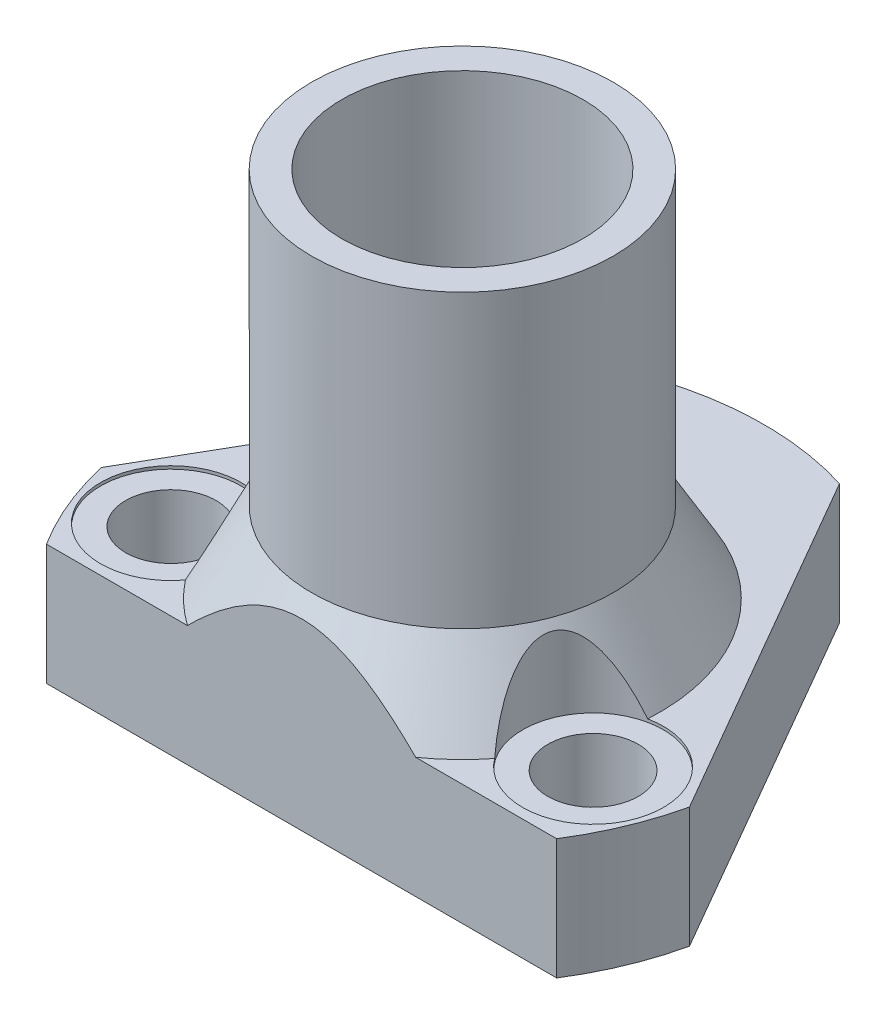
ISO-10303-21;
HEADER;
FILE_DESCRIPTION(('STEP AP214'),'2;1');
FILE_NAME('part.step','',(''),(''),'','','');
FILE_SCHEMA(('AUTOMOTIVE_DESIGN { 1 0 10303 214 1 1 1 1 }'));
ENDSEC;
DATA;
#1=APPLICATION_CONTEXT('core data for automotive mechanical design processes');
#2=APPLICATION_PROTOCOL_DEFINITION('international standard','automotive_design',2000,#1);
#3=PRODUCT_CONTEXT('',#1,'mechanical');
#4=PRODUCT('Part','Part','',(#3));
#5=PRODUCT_RELATED_PRODUCT_CATEGORY('part','',(#4));
#6=PRODUCT_DEFINITION_FORMATION('','',#4);
#7=PRODUCT_DEFINITION_CONTEXT('part definition',#1,'design');
#8=PRODUCT_DEFINITION('design','',#6,#7);
#9=PRODUCT_DEFINITION_SHAPE('','',#8);
#10=(LENGTH_UNIT() NAMED_UNIT(*) SI_UNIT(.MILLI.,.METRE.));
#11=(NAMED_UNIT(*) PLANE_ANGLE_UNIT() SI_UNIT($,.RADIAN.));
#12=(NAMED_UNIT(*) SI_UNIT($,.STERADIAN.) SOLID_ANGLE_UNIT());
#13=UNCERTAINTY_MEASURE_WITH_UNIT(LENGTH_MEASURE(1.E-05),#10,'distance_accuracy_value','');
#14=(GEOMETRIC_REPRESENTATION_CONTEXT(3) GLOBAL_UNCERTAINTY_ASSIGNED_CONTEXT((#13)) GLOBAL_UNIT_ASSIGNED_CONTEXT((#10,
#11,#12)) REPRESENTATION_CONTEXT('',''));
#15=CARTESIAN_POINT('',(0.,0.,0.));
#16=DIRECTION('',(0.,0.,1.));
#17=DIRECTION('',(1.,0.,0.));
#18=AXIS2_PLACEMENT_3D('',#15,#16,#17);
#19=CARTESIAN_POINT('',(10.5,14.45,0.));
#20=DIRECTION('',(0.,-1.,0.));
#21=DIRECTION('',(0.,0.,-1.));
#22=AXIS2_PLACEMENT_3D('',#19,#20,#21);
#23=PLANE('',#22);
#24=CARTESIAN_POINT('',(0.,14.45,0.));
#25=DIRECTION('',(0.,-1.,0.));
#26=DIRECTION('',(0.,0.,-1.));
#27=AXIS2_PLACEMENT_3D('',#24,#25,#26);
#28=CIRCLE('',#27,11.1);
#29=CARTESIAN_POINT('',(0.,14.45,-11.1));
#30=VERTEX_POINT('',#29);
#31=EDGE_CURVE('E10',#30,#30,#28,.F.);
#32=ORIENTED_EDGE('',*,*,#31,.F.);
#33=EDGE_LOOP('',(#32));
#34=FACE_BOUND('',#33,.T.);
#35=CARTESIAN_POINT('',(0.,14.45,0.));
#36=DIRECTION('',(0.,-1.,0.));
#37=DIRECTION('',(0.,0.,-1.));
#38=AXIS2_PLACEMENT_3D('',#35,#36,#37);
#39=CIRCLE('',#38,10.5);
#40=CARTESIAN_POINT('',(0.,14.45,-10.5));
#41=VERTEX_POINT('',#40);
#42=EDGE_CURVE('E207',#41,#41,#39,.T.);
#43=ORIENTED_EDGE('',*,*,#42,.F.);
#44=EDGE_LOOP('',(#43));
#45=FACE_BOUND('',#44,.T.);
#46=ADVANCED_FACE('F17',(#34,#45),#23,.T.);
#47=CARTESIAN_POINT('',(0.,24.4,0.));
#48=DIRECTION('',(0.,-1.,0.));
#49=DIRECTION('',(0.,0.,-1.));
#50=AXIS2_PLACEMENT_3D('',#47,#48,#49);
#51=TOROIDAL_SURFACE('',#50,11.85,0.4);
#52=CARTESIAN_POINT('',(0.,24.,0.));
#53=DIRECTION('',(0.,-1.,0.));
#54=DIRECTION('',(0.,0.,-1.));
#55=AXIS2_PLACEMENT_3D('',#52,#53,#54);
#56=CIRCLE('',#55,11.85);
#57=CARTESIAN_POINT('',(0.,24.,-11.85));
#58=VERTEX_POINT('',#57);
#59=EDGE_CURVE('E782',#58,#58,#56,.T.);
#60=ORIENTED_EDGE('',*,*,#59,.T.);
#61=EDGE_LOOP('',(#60));
#62=FACE_BOUND('',#61,.T.);
#63=CARTESIAN_POINT('',(0.,24.0291900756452,0.));
#64=DIRECTION('',(0.,1.,0.));
#65=DIRECTION('',(0.,0.,1.));
#66=AXIS2_PLACEMENT_3D('',#63,#64,#65);
#67=CIRCLE('',#66,12.);
#68=CARTESIAN_POINT('',(0.,24.0291900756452,12.));
#69=VERTEX_POINT('',#68);
#70=EDGE_CURVE('E214',#69,#69,#67,.T.);
#71=ORIENTED_EDGE('',*,*,#70,.T.);
#72=EDGE_LOOP('',(#71));
#73=FACE_BOUND('',#72,.T.);
#74=ADVANCED_FACE('F274',(#62,#73),#51,.F.);
#75=CARTESIAN_POINT('',(-21.,22.,8.));
#76=DIRECTION('',(0.,-1.,0.));
#77=DIRECTION('',(0.,0.,-1.));
#78=AXIS2_PLACEMENT_3D('',#75,#76,#77);
#79=CYLINDRICAL_SURFACE('',#78,4.5);
#80=CARTESIAN_POINT('',(-21.,0.,8.));
#81=DIRECTION('',(0.,1.,0.));
#82=DIRECTION('',(0.,0.,1.));
#83=AXIS2_PLACEMENT_3D('',#80,#81,#82);
#84=CIRCLE('',#83,4.5);
#85=CARTESIAN_POINT('',(-21.,0.,12.5));
#86=VERTEX_POINT('',#85);
#87=EDGE_CURVE('E831',#86,#86,#84,.T.);
#88=ORIENTED_EDGE('',*,*,#87,.F.);
#89=EDGE_LOOP('',(#88));
#90=FACE_BOUND('',#89,.T.);
#91=CARTESIAN_POINT('',(-21.,11.7,8.));
#92=DIRECTION('',(0.,1.,0.));
#93=DIRECTION('',(0.,0.,1.));
#94=AXIS2_PLACEMENT_3D('',#91,#92,#93);
#95=CIRCLE('',#94,4.5);
#96=CARTESIAN_POINT('',(-21.,11.7,12.5));
#97=VERTEX_POINT('',#96);
#98=EDGE_CURVE('E763',#97,#97,#95,.T.);
#99=ORIENTED_EDGE('',*,*,#98,.T.);
#100=EDGE_LOOP('',(#99));
#101=FACE_BOUND('',#100,.T.);
#102=ADVANCED_FACE('F277',(#90,#101),#79,.F.);
#103=CARTESIAN_POINT('',(21.,22.,8.));
#104=DIRECTION('',(0.,-1.,0.));
#105=DIRECTION('',(0.,0.,-1.));
#106=AXIS2_PLACEMENT_3D('',#103,#104,#105);
#107=CYLINDRICAL_SURFACE('',#106,4.5);
#108=CARTESIAN_POINT('',(21.,0.,8.));
#109=DIRECTION('',(0.,1.,0.));
#110=DIRECTION('',(0.,0.,1.));
#111=AXIS2_PLACEMENT_3D('',#108,#109,#110);
#112=CIRCLE('',#111,4.5);
#113=CARTESIAN_POINT('',(21.,0.,12.5));
#114=VERTEX_POINT('',#113);
#115=EDGE_CURVE('E832',#114,#114,#112,.T.);
#116=ORIENTED_EDGE('',*,*,#115,.F.);
#117=EDGE_LOOP('',(#116));
#118=FACE_BOUND('',#117,.T.);
#119=CARTESIAN_POINT('',(21.,11.7,8.));
#120=DIRECTION('',(0.,1.,0.));
#121=DIRECTION('',(0.,0.,1.));
#122=AXIS2_PLACEMENT_3D('',#119,#120,#121);
#123=CIRCLE('',#122,4.5);
#124=CARTESIAN_POINT('',(21.,11.7,12.5));
#125=VERTEX_POINT('',#124);
#126=EDGE_CURVE('E774',#125,#125,#123,.T.);
#127=ORIENTED_EDGE('',*,*,#126,.T.);
#128=EDGE_LOOP('',(#127));
#129=FACE_BOUND('',#128,.T.);
#130=ADVANCED_FACE('F616',(#118,#129),#107,.F.);
#131=CARTESIAN_POINT('',(0.,12.,0.));
#132=DIRECTION('',(0.,-1.,0.));
#133=DIRECTION('',(0.,0.,-1.));
#134=AXIS2_PLACEMENT_3D('',#131,#132,#133);
#135=CONICAL_SURFACE('',#134,19.6188021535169,0.523598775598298);
#136=CARTESIAN_POINT('',(3.9799296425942,20.4002,-14.2225834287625));
#137=CARTESIAN_POINT('',(3.99476304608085,20.2525073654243,-14.3069551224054));
#138=CARTESIAN_POINT('',(4.00128389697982,20.105266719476,-14.3934219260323));
#139=CARTESIAN_POINT('',(3.99829718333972,19.8128643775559,-14.5693983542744));
#140=CARTESIAN_POINT('',(3.98879735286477,19.6677017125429,-14.6589064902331));
#141=CARTESIAN_POINT('',(3.95435316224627,19.3802689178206,-14.8400383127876));
#142=CARTESIAN_POINT('',(3.92938551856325,19.2380034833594,-14.9316649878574));
#143=CARTESIAN_POINT('',(3.86445772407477,18.9575554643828,-15.1157810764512));
#144=CARTESIAN_POINT('',(3.8244967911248,18.8193730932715,-15.208270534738));
#145=CARTESIAN_POINT('',(3.6923800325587,18.4402684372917,-15.4663369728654));
#146=CARTESIAN_POINT('',(3.58395546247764,18.2046901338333,-15.6317604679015));
#147=CARTESIAN_POINT('',(3.32095601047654,17.7552359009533,-15.9548695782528));
#148=CARTESIAN_POINT('',(3.16643311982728,17.5413358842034,-16.11256367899));
#149=CARTESIAN_POINT('',(2.84875554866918,17.1841352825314,-16.3806341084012));
#150=CARTESIAN_POINT('',(2.69420528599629,17.0354358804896,-16.4939986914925));
#151=CARTESIAN_POINT('',(2.35702439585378,16.7609297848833,-16.7056042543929));
#152=CARTESIAN_POINT('',(2.1744350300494,16.6350900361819,-16.8038670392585));
#153=CARTESIAN_POINT('',(1.81874631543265,16.4326505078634,-16.9632055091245));
#154=CARTESIAN_POINT('',(1.64999434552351,16.3512558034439,-17.0277950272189));
#155=CARTESIAN_POINT('',(1.38585300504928,16.2465462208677,-17.1112663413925));
#156=CARTESIAN_POINT('',(1.29594086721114,16.2145329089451,-17.1368604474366));
#157=CARTESIAN_POINT('',(1.11292376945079,16.156746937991,-17.1831499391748));
#158=CARTESIAN_POINT('',(1.01982020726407,16.130971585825,-17.2038474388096));
#159=CARTESIAN_POINT('',(0.830364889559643,16.0859174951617,-17.2400774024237));
#160=CARTESIAN_POINT('',(0.733995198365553,16.0666846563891,-17.2555733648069));
#161=CARTESIAN_POINT('',(0.539410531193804,16.0353132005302,-17.2808721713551));
#162=CARTESIAN_POINT('',(0.441196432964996,16.0231712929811,-17.2906776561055));
#163=CARTESIAN_POINT('',(0.243742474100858,16.006203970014,-17.304384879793));
#164=CARTESIAN_POINT('',(0.144502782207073,16.0013773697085,-17.3082875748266));
#165=CARTESIAN_POINT('',(-0.0541089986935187,15.9991333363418,-17.3101017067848));
#166=CARTESIAN_POINT('',(-0.153481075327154,16.0017152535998,-17.3080136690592));
#167=CARTESIAN_POINT('',(-0.34095453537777,16.0135715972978,-17.2984322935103));
#168=CARTESIAN_POINT('',(-0.42913417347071,16.0221076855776,-17.2915353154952));
#169=CARTESIAN_POINT('',(-0.604268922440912,16.0449182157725,-17.2731246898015));
#170=CARTESIAN_POINT('',(-0.691223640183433,16.0591944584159,-17.2616095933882));
#171=CARTESIAN_POINT('',(-0.949305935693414,16.1103355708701,-17.2204179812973));
#172=CARTESIAN_POINT('',(-1.11782469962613,16.1555242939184,-17.1840857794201));
#173=CARTESIAN_POINT('',(-1.4479337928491,16.2670812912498,-17.0948365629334));
#174=CARTESIAN_POINT('',(-1.60923964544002,16.3339580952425,-17.0415219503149));
#175=CARTESIAN_POINT('',(-1.91785245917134,16.4855390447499,-16.9214884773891));
#176=CARTESIAN_POINT('',(-2.06515079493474,16.5702540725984,-16.8547614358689));
#177=CARTESIAN_POINT('',(-2.40239410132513,16.7930395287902,-16.6807277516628));
#178=CARTESIAN_POINT('',(-2.58462136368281,16.9386522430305,-16.5680815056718));
#179=CARTESIAN_POINT('',(-2.9167461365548,17.2531676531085,-16.3284411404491));
#180=CARTESIAN_POINT('',(-3.06658833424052,17.4221094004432,-16.201423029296));
#181=CARTESIAN_POINT('',(-3.33522857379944,17.7803132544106,-15.9370577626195));
#182=CARTESIAN_POINT('',(-3.45359925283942,17.9698102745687,-15.7995981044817));
#183=CARTESIAN_POINT('',(-3.656488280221,18.3632215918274,-15.5206250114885));
#184=CARTESIAN_POINT('',(-3.74102177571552,18.5671293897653,-15.3791134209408));
#185=CARTESIAN_POINT('',(-3.84968544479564,18.9053587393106,-15.1506700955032));
#186=CARTESIAN_POINT('',(-3.88454354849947,19.0362962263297,-15.0636699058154));
#187=CARTESIAN_POINT('',(-3.94090236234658,19.3016579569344,-14.8905977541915));
#188=CARTESIAN_POINT('',(-3.96240273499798,19.4360822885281,-14.8045258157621));
#189=CARTESIAN_POINT('',(-3.99165958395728,19.7078261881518,-14.6341064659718));
#190=CARTESIAN_POINT('',(-3.99939296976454,19.8451502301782,-14.5497621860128));
#191=CARTESIAN_POINT('',(-4.00053786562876,20.1215839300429,-14.3838486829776));
#192=CARTESIAN_POINT('',(-3.99394399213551,20.2606942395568,-14.3022805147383));
#193=CARTESIAN_POINT('',(-3.9799296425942,20.4002,-14.2225834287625));
#194=B_SPLINE_CURVE_WITH_KNOTS('',3,(#136,#137,#138,#139,#140,#141,#142,#143,#144,#145,#146,
#147,#148,#149,#150,#151,#152,#153,#154,#155,#156,#157,#158,#159,#160,#161,#162,#163,#164,#165,
#166,#167,#168,#169,#170,#171,#172,#173,#174,#175,#176,#177,#178,#179,#180,#181,#182,#183,#184,
#185,#186,#187,#188,#189,#190,#191,#192,#193),.UNSPECIFIED.,.F.,.F.,(4,2,2,2,2,2,2,2,2,2,2,2,2,
2,2,2,2,2,2,2,2,2,2,2,2,2,2,2,4),(0.,0.511886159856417,1.02352527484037,1.53593643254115,
2.04837432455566,2.96682694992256,3.8842476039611,4.60929354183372,5.333282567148,
5.9251696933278,6.22129615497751,6.51729454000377,6.81532865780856,7.1132243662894,
7.41107181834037,7.70889315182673,7.97514864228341,8.24148772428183,8.77365132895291,
9.31932408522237,9.8653307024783,10.6382562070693,11.4124915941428,12.1967580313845,
12.9806729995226,13.4632248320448,13.9457888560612,14.4291614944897,14.9127157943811),.UNSPECIFIED.);
#195=CARTESIAN_POINT('',(4.,20.,-14.456832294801));
#196=VERTEX_POINT('',#195);
#197=CARTESIAN_POINT('',(-4.,20.,-14.456832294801));
#198=VERTEX_POINT('',#197);
#199=EDGE_CURVE('E32',#196,#198,#194,.T.);
#200=ORIENTED_EDGE('',*,*,#199,.F.);
#201=CARTESIAN_POINT('',(0.,20.,0.));
#202=DIRECTION('',(0.,-1.,0.));
#203=DIRECTION('',(0.,0.,-1.));
#204=AXIS2_PLACEMENT_3D('',#201,#202,#203);
#205=CIRCLE('',#204,15.);
#206=EDGE_CURVE('E791',#196,#198,#205,.T.);
#207=ORIENTED_EDGE('',*,*,#206,.T.);
#208=EDGE_LOOP('',(#200,#207));
#209=FACE_BOUND('',#208,.T.);
#210=CARTESIAN_POINT('',(-15.3826872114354,11.9998,12.1768166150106));
#211=CARTESIAN_POINT('',(-15.3167716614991,12.1846245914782,12.088153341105));
#212=CARTESIAN_POINT('',(-15.2526085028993,12.369123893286,11.9974922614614));
#213=CARTESIAN_POINT('',(-15.1279295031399,12.7372851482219,11.8119957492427));
#214=CARTESIAN_POINT('',(-15.0674141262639,12.9209469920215,11.7171597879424));
#215=CARTESIAN_POINT('',(-14.9499886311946,13.2878287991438,11.5228238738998));
#216=CARTESIAN_POINT('',(-14.8930916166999,13.4710450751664,11.4233090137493));
#217=CARTESIAN_POINT('',(-14.7833293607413,13.8361232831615,11.2196873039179));
#218=CARTESIAN_POINT('',(-14.7304639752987,14.0179852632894,11.1155806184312));
#219=CARTESIAN_POINT('',(-14.626864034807,14.3876721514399,10.8979765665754));
#220=CARTESIAN_POINT('',(-14.5763135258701,14.5754248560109,10.7842683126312));
#221=CARTESIAN_POINT('',(-14.480203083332,14.9486243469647,10.5511077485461));
#222=CARTESIAN_POINT('',(-14.4346429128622,15.1340712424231,10.4316557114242));
#223=CARTESIAN_POINT('',(-14.3490184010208,15.5017952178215,10.1866114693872));
#224=CARTESIAN_POINT('',(-14.3089466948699,15.684076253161,10.0610278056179));
#225=CARTESIAN_POINT('',(-14.2348215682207,16.0448546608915,9.80288568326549));
#226=CARTESIAN_POINT('',(-14.2007669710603,16.2233527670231,9.67032859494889));
#227=CARTESIAN_POINT('',(-14.1398549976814,16.5731316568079,9.39910050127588));
#228=CARTESIAN_POINT('',(-14.1129091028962,16.7444763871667,9.26053245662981));
#229=CARTESIAN_POINT('',(-14.0666516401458,17.080877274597,8.97451984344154));
#230=CARTESIAN_POINT('',(-14.0473437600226,17.2459303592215,8.82707102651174));
#231=CARTESIAN_POINT('',(-14.0179487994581,17.5657506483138,8.52345868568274));
#232=CARTESIAN_POINT('',(-14.0077745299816,17.7206017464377,8.36739299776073));
#233=CARTESIAN_POINT('',(-13.9982675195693,18.0181133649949,8.0438743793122));
#234=CARTESIAN_POINT('',(-13.9989213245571,18.1607887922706,7.87643583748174));
#235=CARTESIAN_POINT('',(-14.0126013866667,18.4082681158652,7.55503609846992));
#236=CARTESIAN_POINT('',(-14.0237248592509,18.5155289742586,7.40291593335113));
#237=CARTESIAN_POINT('',(-14.0577730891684,18.7127318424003,7.08867407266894));
#238=CARTESIAN_POINT('',(-14.0807075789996,18.8026594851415,6.92654422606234));
#239=CARTESIAN_POINT('',(-14.1411921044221,18.9594498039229,6.59072510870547));
#240=CARTESIAN_POINT('',(-14.1789373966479,19.0259808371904,6.4169082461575));
#241=CARTESIAN_POINT('',(-14.2475665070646,19.1010711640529,6.15257893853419));
#242=CARTESIAN_POINT('',(-14.272425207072,19.1219781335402,6.06392576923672));
#243=CARTESIAN_POINT('',(-14.3261524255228,19.1548282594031,5.88615095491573));
#244=CARTESIAN_POINT('',(-14.3550201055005,19.1667732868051,5.79702941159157));
#245=CARTESIAN_POINT('',(-14.4130018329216,19.1803237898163,5.6296921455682));
#246=CARTESIAN_POINT('',(-14.4416961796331,19.1829708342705,5.55141434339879));
#247=CARTESIAN_POINT('',(-14.5018290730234,19.180777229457,5.39601530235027));
#248=CARTESIAN_POINT('',(-14.5332685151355,19.1759341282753,5.31889445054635));
#249=CARTESIAN_POINT('',(-14.6312506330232,19.1503298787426,5.09029480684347));
#250=CARTESIAN_POINT('',(-14.7014788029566,19.1184986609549,4.94151650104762));
#251=CARTESIAN_POINT('',(-14.8590489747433,19.0228961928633,4.63508047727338));
#252=CARTESIAN_POINT('',(-14.9473997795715,18.955190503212,4.47922193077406));
#253=CARTESIAN_POINT('',(-15.128896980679,18.7945657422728,4.18420519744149));
#254=CARTESIAN_POINT('',(-15.2220521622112,18.7015990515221,4.0450792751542));
#255=CARTESIAN_POINT('',(-15.3949761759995,18.5145594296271,3.80454214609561));
#256=CARTESIAN_POINT('',(-15.4744076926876,18.4232181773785,3.70070042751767));
#257=CARTESIAN_POINT('',(-15.6341400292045,18.2309672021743,3.50292149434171));
#258=CARTESIAN_POINT('',(-15.7144414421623,18.130050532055,3.4089915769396));
#259=CARTESIAN_POINT('',(-15.8755735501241,17.9207607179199,3.22980058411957));
#260=CARTESIAN_POINT('',(-15.9564050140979,17.812371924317,3.14455869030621));
#261=CARTESIAN_POINT('',(-16.1182180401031,17.5899383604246,2.98189622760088));
#262=CARTESIAN_POINT('',(-16.1991996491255,17.4758913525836,2.90447879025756));
#263=CARTESIAN_POINT('',(-16.3667607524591,17.2353471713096,2.75149129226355));
#264=CARTESIAN_POINT('',(-16.4533399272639,17.1085345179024,2.67641957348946));
#265=CARTESIAN_POINT('',(-16.6264343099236,16.8509314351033,2.53332684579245));
#266=CARTESIAN_POINT('',(-16.7129494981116,16.7201400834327,2.46530748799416));
#267=CARTESIAN_POINT('',(-16.972492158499,16.3228384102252,2.27059176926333));
#268=CARTESIAN_POINT('',(-17.1453878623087,16.0515879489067,2.15335296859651));
#269=CARTESIAN_POINT('',(-17.4911373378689,15.5003185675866,1.93953828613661));
#270=CARTESIAN_POINT('',(-17.6639902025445,15.2202818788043,1.84300784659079));
#271=CARTESIAN_POINT('',(-18.0093480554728,14.6546573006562,1.66806300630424));
#272=CARTESIAN_POINT('',(-18.1818531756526,14.3690722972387,1.58963944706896));
#273=CARTESIAN_POINT('',(-18.5604322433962,13.7376741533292,1.43508525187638));
#274=CARTESIAN_POINT('',(-18.7664763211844,13.3910006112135,1.36239965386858));
#275=CARTESIAN_POINT('',(-19.0746527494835,12.8695076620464,1.26914479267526));
#276=CARTESIAN_POINT('',(-19.1768536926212,12.6960735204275,1.24076495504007));
#277=CARTESIAN_POINT('',(-19.3812117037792,12.3484609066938,1.18893342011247));
#278=CARTESIAN_POINT('',(-19.4833687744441,12.1742824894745,1.1654813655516));
#279=CARTESIAN_POINT('',(-19.5855118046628,11.9998,1.14440205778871));
#280=B_SPLINE_CURVE_WITH_KNOTS('',3,(#210,#211,#212,#213,#214,#215,#216,#217,#218,#219,#220,
#221,#222,#223,#224,#225,#226,#227,#228,#229,#230,#231,#232,#233,#234,#235,#236,#237,#238,#239,
#240,#241,#242,#243,#244,#245,#246,#247,#248,#249,#250,#251,#252,#253,#254,#255,#256,#257,#258,
#259,#260,#261,#262,#263,#264,#265,#266,#267,#268,#269,#270,#271,#272,#273,#274,#275,#276,#277,
#278,#279),.UNSPECIFIED.,.F.,.F.,(4,2,2,2,2,2,2,2,2,2,2,2,2,2,2,2,2,2,2,2,2,2,2,2,2,2,2,2,2,2,2,
2,2,2,4),(0.,0.645977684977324,1.29203741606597,1.9403172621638,2.58857394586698,
3.26418512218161,3.939764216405,4.61442770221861,5.28895910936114,5.95464569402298,
6.62065329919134,7.28023345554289,7.93899413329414,8.49725290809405,9.05597243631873,
9.62231959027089,9.90513526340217,10.18789187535,10.4377398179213,10.6876695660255,
11.1873336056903,11.7588423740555,12.3314360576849,12.8092257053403,13.2873646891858,
13.7665374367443,14.2459012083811,14.7584285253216,15.2710755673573,16.2971320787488,
17.3254176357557,18.3531819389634,19.5818555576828,20.1916991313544,20.8014984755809),.UNSPECIFIED.);
#281=CARTESIAN_POINT('',(-15.3826158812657,12.,12.1767206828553));
#282=VERTEX_POINT('',#281);
#283=CARTESIAN_POINT('',(-19.5853947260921,12.,1.14442621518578));
#284=VERTEX_POINT('',#283);
#285=EDGE_CURVE('E39',#282,#284,#280,.T.);
#286=ORIENTED_EDGE('',*,*,#285,.F.);
#287=CARTESIAN_POINT('',(0.,12.,0.));
#288=DIRECTION('',(0.,-1.,0.));
#289=DIRECTION('',(0.,0.,-1.));
#290=AXIS2_PLACEMENT_3D('',#287,#288,#289);
#291=CIRCLE('',#290,19.6188021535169);
#292=CARTESIAN_POINT('',(-11.3532989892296,12.,16.));
#293=VERTEX_POINT('',#292);
#294=EDGE_CURVE('E794',#293,#282,#291,.T.);
#295=ORIENTED_EDGE('',*,*,#294,.F.);
#296=CARTESIAN_POINT('',(-26.6550129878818,-7.8659569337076,16.));
#297=CARTESIAN_POINT('',(-26.3671704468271,-7.43850184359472,16.));
#298=CARTESIAN_POINT('',(-26.0784837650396,-7.01161553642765,16.));
#299=CARTESIAN_POINT('',(-25.4992514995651,-6.15910231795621,16.));
#300=CARTESIAN_POINT('',(-25.2087059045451,-5.73347541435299,16.));
#301=CARTESIAN_POINT('',(-24.3339415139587,-4.45854526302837,16.));
#302=CARTESIAN_POINT('',(-23.7466824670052,-3.61132252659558,16.));
#303=CARTESIAN_POINT('',(-22.5583410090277,-1.91800195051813,16.));
#304=CARTESIAN_POINT('',(-21.9571917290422,-1.07195098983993,16.));
#305=CARTESIAN_POINT('',(-20.7427545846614,0.611312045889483,16.));
#306=CARTESIAN_POINT('',(-20.129467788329,1.44852488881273,16.));
#307=CARTESIAN_POINT('',(-19.1695931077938,2.73400624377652,16.));
#308=CARTESIAN_POINT('',(-18.8283511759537,3.18626816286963,16.));
#309=CARTESIAN_POINT('',(-18.1406858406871,4.0868324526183,16.));
#310=CARTESIAN_POINT('',(-17.7942625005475,4.53513487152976,16.));
#311=CARTESIAN_POINT('',(-17.095376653,5.42723837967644,16.));
#312=CARTESIAN_POINT('',(-16.7429122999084,5.8710380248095,16.));
#313=CARTESIAN_POINT('',(-16.0311483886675,6.75312323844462,16.));
#314=CARTESIAN_POINT('',(-15.6718489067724,7.19140886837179,16.));
#315=CARTESIAN_POINT('',(-14.9464395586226,8.06001977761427,16.));
#316=CARTESIAN_POINT('',(-14.5803542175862,8.49036549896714,16.));
#317=CARTESIAN_POINT('',(-13.8389498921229,9.34309023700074,16.));
#318=CARTESIAN_POINT('',(-13.4636304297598,9.76546883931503,16.));
#319=CARTESIAN_POINT('',(-12.7023612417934,10.6001242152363,16.));
#320=CARTESIAN_POINT('',(-12.3164176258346,11.0124065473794,16.));
#321=CARTESIAN_POINT('',(-11.5317351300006,11.8245694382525,16.));
#322=CARTESIAN_POINT('',(-11.1329982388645,12.2244519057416,16.));
#323=CARTESIAN_POINT('',(-10.510818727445,12.8245275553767,16.));
#324=CARTESIAN_POINT('',(-10.2928655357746,13.0304201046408,16.));
#325=CARTESIAN_POINT('',(-9.85219096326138,13.4370593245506,16.));
#326=CARTESIAN_POINT('',(-9.62946949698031,13.6378059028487,16.));
#327=CARTESIAN_POINT('',(-9.17864836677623,14.0334710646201,16.));
#328=CARTESIAN_POINT('',(-8.95054538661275,14.2283858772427,16.));
#329=CARTESIAN_POINT('',(-8.48857922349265,14.6112784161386,16.));
#330=CARTESIAN_POINT('',(-8.25471611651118,14.7992562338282,16.));
#331=CARTESIAN_POINT('',(-7.78317183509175,15.16515890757,16.));
#332=CARTESIAN_POINT('',(-7.54555686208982,15.3431688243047,16.));
#333=CARTESIAN_POINT('',(-7.06361194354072,15.689844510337,16.));
#334=CARTESIAN_POINT('',(-6.81928257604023,15.8585110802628,16.));
#335=CARTESIAN_POINT('',(-6.3235678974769,16.1847057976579,16.));
#336=CARTESIAN_POINT('',(-6.07218882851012,16.3422433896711,16.));
#337=CARTESIAN_POINT('',(-5.56176715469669,16.6443133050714,16.));
#338=CARTESIAN_POINT('',(-5.30272620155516,16.7888484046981,16.));
#339=CARTESIAN_POINT('',(-4.77681137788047,17.0625111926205,16.));
#340=CARTESIAN_POINT('',(-4.50994314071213,17.1916496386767,16.));
#341=CARTESIAN_POINT('',(-3.96820122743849,17.4319569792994,16.));
#342=CARTESIAN_POINT('',(-3.6933281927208,17.5431273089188,16.));
#343=CARTESIAN_POINT('',(-3.13620831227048,17.744525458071,16.));
#344=CARTESIAN_POINT('',(-2.85396784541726,17.8347707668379,16.));
#345=CARTESIAN_POINT('',(-2.28298553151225,17.9915161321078,16.));
#346=CARTESIAN_POINT('',(-1.99424545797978,18.0580225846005,16.));
#347=CARTESIAN_POINT('',(-1.40847769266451,18.1654038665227,16.));
#348=CARTESIAN_POINT('',(-1.11139252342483,18.2059690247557,16.));
#349=CARTESIAN_POINT('',(-0.514693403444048,18.2584159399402,16.));
#350=CARTESIAN_POINT('',(-0.215079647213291,18.2702998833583,16.));
#351=CARTESIAN_POINT('',(0.383794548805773,18.2648281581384,16.));
#352=CARTESIAN_POINT('',(0.683055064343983,18.2474807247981,16.));
#353=CARTESIAN_POINT('',(1.27855936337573,18.1843776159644,16.));
#354=CARTESIAN_POINT('',(1.57480276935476,18.1386184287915,16.));
#355=CARTESIAN_POINT('',(2.19478697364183,18.0140693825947,16.));
#356=CARTESIAN_POINT('',(2.51789597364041,17.9321567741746,16.));
#357=CARTESIAN_POINT('',(3.1554330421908,17.739403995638,16.));
#358=CARTESIAN_POINT('',(3.46985720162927,17.6285510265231,16.));
#359=CARTESIAN_POINT('',(3.93438872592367,17.4435971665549,16.));
#360=CARTESIAN_POINT('',(4.08826008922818,17.3787289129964,16.));
#361=CARTESIAN_POINT('',(4.39341032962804,17.2433132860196,16.));
#362=CARTESIAN_POINT('',(4.54469024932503,17.172768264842,16.));
#363=CARTESIAN_POINT('',(4.99474078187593,16.9532998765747,16.));
#364=CARTESIAN_POINT('',(5.28971111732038,16.7965476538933,16.));
#365=CARTESIAN_POINT('',(5.9177367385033,16.4383690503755,16.));
#366=CARTESIAN_POINT('',(6.24900907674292,16.233843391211,16.));
#367=CARTESIAN_POINT('',(6.89917085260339,15.8058658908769,16.));
#368=CARTESIAN_POINT('',(7.21805563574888,15.58240703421,16.));
#369=CARTESIAN_POINT('',(7.84501804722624,15.1199255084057,16.));
#370=CARTESIAN_POINT('',(8.15307841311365,14.8808795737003,16.));
#371=CARTESIAN_POINT('',(8.75908546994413,14.3904232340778,16.));
#372=CARTESIAN_POINT('',(9.0570333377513,14.1390142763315,16.));
#373=CARTESIAN_POINT('',(9.64795226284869,13.6225923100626,16.));
#374=CARTESIAN_POINT('',(9.94080291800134,13.3574420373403,16.));
#375=CARTESIAN_POINT('',(10.5184382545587,12.8185089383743,16.));
#376=CARTESIAN_POINT('',(10.8032227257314,12.5447258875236,16.));
#377=CARTESIAN_POINT('',(11.3653910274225,11.9902285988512,16.));
#378=CARTESIAN_POINT('',(11.6427818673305,11.7095214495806,16.));
#379=CARTESIAN_POINT('',(12.1912628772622,11.1420536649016,16.));
#380=CARTESIAN_POINT('',(12.4623533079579,10.8552932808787,16.));
#381=CARTESIAN_POINT('',(13.0397566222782,10.2326127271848,16.));
#382=CARTESIAN_POINT('',(13.3451573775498,9.89584773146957,16.));
#383=CARTESIAN_POINT('',(13.9494956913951,9.21655667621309,16.));
#384=CARTESIAN_POINT('',(14.2484329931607,8.87403038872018,16.));
#385=CARTESIAN_POINT('',(14.8406664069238,8.18404190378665,16.));
#386=CARTESIAN_POINT('',(15.1339615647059,7.83657888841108,16.));
#387=CARTESIAN_POINT('',(15.715522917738,7.13746532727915,16.));
#388=CARTESIAN_POINT('',(16.0037890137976,6.78581469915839,16.));
#389=CARTESIAN_POINT('',(16.8623115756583,5.72497296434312,16.));
#390=CARTESIAN_POINT('',(17.4258855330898,5.01036955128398,16.));
#391=CARTESIAN_POINT('',(18.5387694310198,3.5702862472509,16.));
#392=CARTESIAN_POINT('',(19.088080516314,2.84480723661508,16.));
#393=CARTESIAN_POINT('',(20.1770174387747,1.38277972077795,16.));
#394=CARTESIAN_POINT('',(20.7166038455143,0.646201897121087,16.));
#395=CARTESIAN_POINT('',(21.7862272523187,-0.833860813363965,16.));
#396=CARTESIAN_POINT('',(22.3162640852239,-1.57734582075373,16.));
#397=CARTESIAN_POINT('',(23.3681613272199,-3.069619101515,16.));
#398=CARTESIAN_POINT('',(23.8900249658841,-3.81840510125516,16.));
#399=CARTESIAN_POINT('',(24.9270377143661,-5.3205989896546,16.));
#400=CARTESIAN_POINT('',(25.4421868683,-6.07400684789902,16.));
#401=CARTESIAN_POINT('',(26.8554392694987,-8.15768196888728,16.));
#402=CARTESIAN_POINT('',(27.7475935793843,-9.49198392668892,16.));
#403=CARTESIAN_POINT('',(29.5185109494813,-12.1696417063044,16.));
#404=CARTESIAN_POINT('',(30.3972724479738,-13.5129985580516,16.));
#405=CARTESIAN_POINT('',(32.1384084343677,-16.1977177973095,16.));
#406=CARTESIAN_POINT('',(33.0008527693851,-17.5390349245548,16.));
#407=CARTESIAN_POINT('',(34.2881332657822,-19.5549372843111,16.));
#408=CARTESIAN_POINT('',(34.716130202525,-20.2275080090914,16.));
#409=CARTESIAN_POINT('',(35.5702146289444,-21.5738580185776,16.));
#410=CARTESIAN_POINT('',(35.9963021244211,-22.2476372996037,16.));
#411=CARTESIAN_POINT('',(36.4215346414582,-22.9219559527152,16.));
#412=B_SPLINE_CURVE_WITH_KNOTS('',3,(#296,#297,#298,#299,#300,#301,#302,#303,#304,#305,#306,
#307,#308,#309,#310,#311,#312,#313,#314,#315,#316,#317,#318,#319,#320,#321,#322,#323,#324,#325,
#326,#327,#328,#329,#330,#331,#332,#333,#334,#335,#336,#337,#338,#339,#340,#341,#342,#343,#344,
#345,#346,#347,#348,#349,#350,#351,#352,#353,#354,#355,#356,#357,#358,#359,#360,#361,#362,#363,
#364,#365,#366,#367,#368,#369,#370,#371,#372,#373,#374,#375,#376,#377,#378,#379,#380,#381,#382,
#383,#384,#385,#386,#387,#388,#389,#390,#391,#392,#393,#394,#395,#396,#397,#398,#399,#400,#401,
#402,#403,#404,#405,#406,#407,#408,#409,#410,#411),.UNSPECIFIED.,.F.,.F.,(4,2,2,2,2,2,2,2,2,2,2,
2,2,2,2,2,2,2,2,2,2,2,2,2,2,2,2,2,2,2,2,2,2,2,2,2,2,2,2,2,2,2,2,2,2,2,2,2,2,2,2,2,2,2,2,2,2,4),
(0.,1.54600587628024,3.09202118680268,6.18452153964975,9.29806411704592,12.4113339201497,
14.1109750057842,15.8105953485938,17.5107445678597,19.2108748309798,20.9057421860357,
22.6006974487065,24.2946975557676,25.9884355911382,26.8878456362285,27.7872718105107,
28.6872675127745,29.5872513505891,30.4777515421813,31.3681753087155,32.2578341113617,
33.1473025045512,34.0361457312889,34.9249179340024,35.8129445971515,36.7007318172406,
37.5989282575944,38.4970562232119,39.3949312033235,40.2929171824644,41.2913718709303,
42.2902688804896,42.7911299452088,43.2917845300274,44.293129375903,45.4603093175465,
46.6279236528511,47.7973225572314,48.9665849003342,50.1515345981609,51.3365151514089,
52.5203291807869,53.7040941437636,55.0678582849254,56.431676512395,57.7957234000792,
59.1597971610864,61.8898260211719,64.6196350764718,67.3587560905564,70.0979250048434,
72.8359827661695,75.5740225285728,80.3891597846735,85.2048542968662,89.9887936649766,
92.380400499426,94.7720000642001),.UNSPECIFIED.);
#413=CARTESIAN_POINT('',(11.3532989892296,12.,16.));
#414=VERTEX_POINT('',#413);
#415=EDGE_CURVE('E813',#293,#414,#412,.T.);
#416=ORIENTED_EDGE('',*,*,#415,.T.);
#417=CARTESIAN_POINT('',(15.3826158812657,12.,12.1767206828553));
#418=VERTEX_POINT('',#417);
#419=EDGE_CURVE('E798',#418,#414,#291,.T.);
#420=ORIENTED_EDGE('',*,*,#419,.F.);
#421=CARTESIAN_POINT('',(19.5855118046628,11.9998,1.1444020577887));
#422=CARTESIAN_POINT('',(19.477311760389,12.1846245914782,1.16673558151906));
#423=CARTESIAN_POINT('',(19.3690907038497,12.369123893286,1.19172648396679));
#424=CARTESIAN_POINT('',(19.1525940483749,12.7372851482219,1.24725131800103));
#425=CARTESIAN_POINT('',(19.0443184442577,12.9209469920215,1.2777859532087));
#426=CARTESIAN_POINT('',(18.8273555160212,13.2878287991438,1.34473580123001));
#427=CARTESIAN_POINT('',(18.7186680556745,13.4710450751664,1.38117086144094));
#428=CARTESIAN_POINT('',(18.5012477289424,13.8361232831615,1.46015158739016));
#429=CARTESIAN_POINT('',(18.3925148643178,14.0179852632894,1.50269703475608));
#430=CARTESIAN_POINT('',(18.170391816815,14.3876721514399,1.59621613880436));
#431=CARTESIAN_POINT('',(18.05699871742,14.5754248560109,1.64746968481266));
#432=CARTESIAN_POINT('',(17.8301163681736,14.9486243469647,1.75758537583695));
#433=CARTESIAN_POINT('',(17.7166271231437,15.1340712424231,1.81644715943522));
#434=CARTESIAN_POINT('',(17.4896661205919,15.5017952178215,1.94241120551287));
#435=CARTESIAN_POINT('',(17.3761945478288,15.684076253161,2.0095021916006));
#436=CARTESIAN_POINT('',(17.1491036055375,16.0448546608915,2.15289533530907));
#437=CARTESIAN_POINT('',(17.0354842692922,16.2233527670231,2.22919568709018));
#438=CARTESIAN_POINT('',(16.8095506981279,16.5731316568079,2.39114928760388));
#439=CARTESIAN_POINT('',(16.6972388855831,16.7444763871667,2.4766667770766));
#440=CARTESIAN_POINT('',(16.4724085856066,17.080877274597,2.65940786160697));
#441=CARTESIAN_POINT('',(16.3598900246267,17.2459303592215,2.75663708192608));
#442=CARTESIAN_POINT('',(16.1359382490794,17.5657506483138,2.96373638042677));
#443=CARTESIAN_POINT('',(16.0245050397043,17.7206017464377,3.07347540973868));
#444=CARTESIAN_POINT('',(15.8021557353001,18.0181133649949,3.308667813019));
#445=CARTESIAN_POINT('',(15.6912391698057,18.1607887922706,3.43410149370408));
#446=CARTESIAN_POINT('',(15.4876096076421,18.4082681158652,3.6831395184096));
#447=CARTESIAN_POINT('',(15.3947010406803,18.5155289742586,3.80410345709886));
#448=CARTESIAN_POINT('',(15.211039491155,18.7127318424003,4.06134976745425));
#449=CARTESIAN_POINT('',(15.1202883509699,18.8026594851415,4.19764469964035));
#450=CARTESIAN_POINT('',(14.9420060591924,18.9594498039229,4.48858847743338));
#451=CARTESIAN_POINT('',(14.8545357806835,19.0259808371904,4.643462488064));
#452=CARTESIAN_POINT('',(14.7298992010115,19.1010711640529,4.88645561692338));
#453=CARTESIAN_POINT('',(14.6894720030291,19.1219781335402,4.96917792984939));
#454=CARTESIAN_POINT('',(14.6112993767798,19.1548282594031,5.13764020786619));
#455=CARTESIAN_POINT('',(14.5735533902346,19.1667732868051,5.22337953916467));
#456=CARTESIAN_POINT('',(14.5055014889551,19.1803237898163,5.38688054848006));
#457=CARTESIAN_POINT('',(14.4748409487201,19.1829708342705,5.46440932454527));
#458=CARTESIAN_POINT('',(14.416338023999,19.180777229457,5.62042930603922));
#459=CARTESIAN_POINT('',(14.3884965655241,19.1759341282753,5.69892081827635));
#460=CARTESIAN_POINT('',(14.3095456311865,19.1503298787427,5.93477043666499));
#461=CARTESIAN_POINT('',(14.2629842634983,19.1184986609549,6.09256466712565));
#462=CARTESIAN_POINT('',(14.1767297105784,19.0228961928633,6.42616854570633));
#463=CARTESIAN_POINT('',(14.1389867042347,18.955190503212,6.60130625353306));
#464=CARTESIAN_POINT('',(14.0781922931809,18.7945657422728,6.94230500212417));
#465=CARTESIAN_POINT('',(14.0551689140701,18.7015990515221,7.10814780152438));
#466=CARTESIAN_POINT('',(14.0242221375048,18.5145594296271,7.40277149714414));
#467=CARTESIAN_POINT('',(14.0144297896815,18.4232181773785,7.53314242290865));
#468=CARTESIAN_POINT('',(14.0020839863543,18.2309672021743,7.78706860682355));
#469=CARTESIAN_POINT('',(13.9995358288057,18.130050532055,7.9106188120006));
#470=CARTESIAN_POINT('',(14.0006024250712,17.9207607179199,8.15159978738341));
#471=CARTESIAN_POINT('',(14.004230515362,17.812371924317,8.26901674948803));
#472=CARTESIAN_POINT('',(14.0168026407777,17.5899383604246,8.4981116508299));
#473=CARTESIAN_POINT('',(14.0257487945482,17.4758913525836,8.60978728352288));
#474=CARTESIAN_POINT('',(14.049049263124,17.2353471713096,8.83548395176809));
#475=CARTESIAN_POINT('',(14.0637349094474,17.1085345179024,8.94913274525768));
#476=CARTESIAN_POINT('',(14.0977496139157,16.8509314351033,9.17112417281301));
#477=CARTESIAN_POINT('',(14.1170797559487,16.7201400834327,9.27946556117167));
#478=CARTESIAN_POINT('',(14.1812839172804,16.3228384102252,9.59751340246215));
#479=CARTESIAN_POINT('',(14.232352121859,16.0515879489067,9.80007178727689));
#480=CARTESIAN_POINT('',(14.3482052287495,15.5003185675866,10.1897350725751));
#481=CARTESIAN_POINT('',(14.4130196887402,15.2202818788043,10.3768054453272));
#482=CARTESIAN_POINT('',(14.5544423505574,14.6546573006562,10.7371904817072));
#483=CARTESIAN_POINT('',(14.6310445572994,14.3690722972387,10.9105120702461));
#484=CARTESIAN_POINT('',(14.8108348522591,13.7376741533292,11.2777784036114));
#485=CARTESIAN_POINT('',(14.9162927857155,13.3910006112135,11.4691314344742));
#486=CARTESIAN_POINT('',(15.0843103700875,12.8695076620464,11.7437935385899));
#487=CARTESIAN_POINT('',(15.141724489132,12.6960735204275,11.8329791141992));
#488=CARTESIAN_POINT('',(15.2597988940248,12.3484609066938,12.0076420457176));
#489=CARTESIAN_POINT('',(15.3204589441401,12.1742824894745,12.0931196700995));
#490=CARTESIAN_POINT('',(15.3826872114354,11.9998,12.1768166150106));
#491=B_SPLINE_CURVE_WITH_KNOTS('',3,(#421,#422,#423,#424,#425,#426,#427,#428,#429,#430,#431,
#432,#433,#434,#435,#436,#437,#438,#439,#440,#441,#442,#443,#444,#445,#446,#447,#448,#449,#450,
#451,#452,#453,#454,#455,#456,#457,#458,#459,#460,#461,#462,#463,#464,#465,#466,#467,#468,#469,
#470,#471,#472,#473,#474,#475,#476,#477,#478,#479,#480,#481,#482,#483,#484,#485,#486,#487,#488,
#489,#490),.UNSPECIFIED.,.F.,.F.,(4,2,2,2,2,2,2,2,2,2,2,2,2,2,2,2,2,2,2,2,2,2,2,2,2,2,2,2,2,2,2,
2,2,2,4),(0.,0.645977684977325,1.29203741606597,1.9403172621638,2.58857394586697,
3.26418512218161,3.93976421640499,4.6144277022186,5.28895910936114,5.95464569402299,
6.62065329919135,7.28023345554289,7.93899413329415,8.49725290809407,9.05597243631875,
9.6223195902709,9.90513526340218,10.18789187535,10.4377398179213,10.6876695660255,
11.1873336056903,11.7588423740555,12.3314360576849,12.8092257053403,13.2873646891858,
13.7665374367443,14.2459012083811,14.7584285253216,15.2710755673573,16.2971320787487,
17.3254176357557,18.3531819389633,19.5818555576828,20.1916991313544,20.8014984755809),.UNSPECIFIED.);
#492=CARTESIAN_POINT('',(19.5853947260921,12.,1.14442621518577));
#493=VERTEX_POINT('',#492);
#494=EDGE_CURVE('E777',#493,#418,#491,.T.);
#495=ORIENTED_EDGE('',*,*,#494,.F.);
#496=EDGE_CURVE('E797',#284,#493,#291,.T.);
#497=ORIENTED_EDGE('',*,*,#496,.F.);
#498=EDGE_LOOP('',(#286,#295,#416,#420,#495,#497));
#499=FACE_BOUND('',#498,.T.);
#500=ADVANCED_FACE('F229',(#209,#499),#135,.T.);
#501=CARTESIAN_POINT('',(19.6188021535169,12.,0.));
#502=DIRECTION('',(0.,1.,0.));
#503=DIRECTION('',(0.,0.,1.));
#504=AXIS2_PLACEMENT_3D('',#501,#502,#503);
#505=PLANE('',#504);
#506=CARTESIAN_POINT('',(-21.,12.,8.));
#507=DIRECTION('',(0.,1.,0.));
#508=DIRECTION('',(0.,0.,1.));
#509=AXIS2_PLACEMENT_3D('',#506,#507,#508);
#510=CIRCLE('',#509,7.);
#511=EDGE_CURVE('E252',#284,#282,#510,.T.);
#512=ORIENTED_EDGE('',*,*,#511,.F.);
#513=ORIENTED_EDGE('',*,*,#496,.T.);
#514=CARTESIAN_POINT('',(21.,12.,8.));
#515=DIRECTION('',(0.,1.,0.));
#516=DIRECTION('',(0.,0.,1.));
#517=AXIS2_PLACEMENT_3D('',#514,#515,#516);
#518=CIRCLE('',#517,7.);
#519=EDGE_CURVE('E770',#418,#493,#518,.T.);
#520=ORIENTED_EDGE('',*,*,#519,.F.);
#521=ORIENTED_EDGE('',*,*,#419,.T.);
#522=DIRECTION('',(1.,0.,0.));
#523=VECTOR('',#522,1.);
#524=CARTESIAN_POINT('',(19.6188021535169,12.,16.));
#525=LINE('',#524,#523);
#526=CARTESIAN_POINT('',(25.3771550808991,12.,16.));
#527=VERTEX_POINT('',#526);
#528=EDGE_CURVE('E820',#414,#527,#525,.T.);
#529=ORIENTED_EDGE('',*,*,#528,.T.);
#530=CARTESIAN_POINT('',(0.,12.,0.));
#531=DIRECTION('',(0.,-1.,0.));
#532=DIRECTION('',(0.,0.,-1.));
#533=AXIS2_PLACEMENT_3D('',#530,#531,#532);
#534=CIRCLE('',#533,30.);
#535=CARTESIAN_POINT('',(29.2505979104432,12.,6.66352173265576));
#536=VERTEX_POINT('',#535);
#537=EDGE_CURVE('E803',#536,#527,#534,.T.);
#538=ORIENTED_EDGE('',*,*,#537,.F.);
#539=DIRECTION('',(-0.5,0.,-0.86602540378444));
#540=VECTOR('',#539,1.);
#541=CARTESIAN_POINT('',(23.9572594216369,12.,-2.50480947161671));
#542=LINE('',#541,#540);
#543=CARTESIAN_POINT('',(8.85451985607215,12.,-28.6635217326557));
#544=VERTEX_POINT('',#543);
#545=EDGE_CURVE('E847',#536,#544,#542,.T.);
#546=ORIENTED_EDGE('',*,*,#545,.T.);
#547=CARTESIAN_POINT('',(-8.85451985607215,12.,-28.6635217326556));
#548=VERTEX_POINT('',#547);
#549=EDGE_CURVE('E802',#548,#544,#534,.T.);
#550=ORIENTED_EDGE('',*,*,#549,.F.);
#551=DIRECTION('',(-0.5,0.,0.86602540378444));
#552=VECTOR('',#551,1.);
#553=CARTESIAN_POINT('',(-14.1478583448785,12.,-19.4951905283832));
#554=LINE('',#553,#552);
#555=CARTESIAN_POINT('',(-29.2505979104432,12.,6.66352173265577));
#556=VERTEX_POINT('',#555);
#557=EDGE_CURVE('E856',#548,#556,#554,.T.);
#558=ORIENTED_EDGE('',*,*,#557,.T.);
#559=CARTESIAN_POINT('',(-25.3771550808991,12.,16.));
#560=VERTEX_POINT('',#559);
#561=EDGE_CURVE('E799',#560,#556,#534,.T.);
#562=ORIENTED_EDGE('',*,*,#561,.F.);
#563=EDGE_CURVE('E812',#560,#293,#525,.T.);
#564=ORIENTED_EDGE('',*,*,#563,.T.);
#565=ORIENTED_EDGE('',*,*,#294,.T.);
#566=EDGE_LOOP('',(#512,#513,#520,#521,#529,#538,#546,#550,#558,#562,#564,#565));
#567=FACE_BOUND('',#566,.T.);
#568=ADVANCED_FACE('F599',(#567),#505,.T.);
#569=CARTESIAN_POINT('',(0.,-5.88970963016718,0.));
#570=DIRECTION('',(0.,-1.,0.));
#571=DIRECTION('',(0.,0.,-1.));
#572=AXIS2_PLACEMENT_3D('',#569,#570,#571);
#573=CYLINDRICAL_SURFACE('',#572,30.);
#574=CARTESIAN_POINT('',(0.,0.,0.));
#575=DIRECTION('',(0.,-1.,0.));
#576=DIRECTION('',(0.,0.,-1.));
#577=AXIS2_PLACEMENT_3D('',#574,#575,#576);
#578=CIRCLE('',#577,30.);
#579=CARTESIAN_POINT('',(-8.85451985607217,0.,-28.6635217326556));
#580=VERTEX_POINT('',#579);
#581=CARTESIAN_POINT('',(8.85451985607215,0.,-28.6635217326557));
#582=VERTEX_POINT('',#581);
#583=EDGE_CURVE('E807',#580,#582,#578,.T.);
#584=ORIENTED_EDGE('',*,*,#583,.F.);
#585=DIRECTION('',(0.,-1.,0.));
#586=VECTOR('',#585,1.);
#587=CARTESIAN_POINT('',(-8.85451985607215,22.,-28.6635217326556));
#588=LINE('',#587,#586);
#589=EDGE_CURVE('E850',#548,#580,#588,.T.);
#590=ORIENTED_EDGE('',*,*,#589,.F.);
#591=ORIENTED_EDGE('',*,*,#549,.T.);
#592=DIRECTION('',(0.,-1.,0.));
#593=VECTOR('',#592,1.);
#594=CARTESIAN_POINT('',(8.85451985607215,22.,-28.6635217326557));
#595=LINE('',#594,#593);
#596=EDGE_CURVE('E844',#544,#582,#595,.T.);
#597=ORIENTED_EDGE('',*,*,#596,.T.);
#598=EDGE_LOOP('',(#584,#590,#591,#597));
#599=FACE_BOUND('',#598,.T.);
#600=ADVANCED_FACE('F583',(#599),#573,.T.);
#601=ORIENTED_EDGE('',*,*,#561,.T.);
#602=DIRECTION('',(0.,-1.,0.));
#603=VECTOR('',#602,1.);
#604=CARTESIAN_POINT('',(-29.2505979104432,22.,6.66352173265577));
#605=LINE('',#604,#603);
#606=CARTESIAN_POINT('',(-29.2505979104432,0.,6.66352173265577));
#607=VERTEX_POINT('',#606);
#608=EDGE_CURVE('E842',#556,#607,#605,.T.);
#609=ORIENTED_EDGE('',*,*,#608,.T.);
#610=CARTESIAN_POINT('',(-25.3771550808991,0.,16.));
#611=VERTEX_POINT('',#610);
#612=EDGE_CURVE('E804',#611,#607,#578,.T.);
#613=ORIENTED_EDGE('',*,*,#612,.F.);
#614=DIRECTION('',(0.,-1.,0.));
#615=VECTOR('',#614,1.);
#616=CARTESIAN_POINT('',(-25.3771550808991,22.,16.));
#617=LINE('',#616,#615);
#618=EDGE_CURVE('E862',#560,#611,#617,.T.);
#619=ORIENTED_EDGE('',*,*,#618,.F.);
#620=EDGE_LOOP('',(#601,#609,#613,#619));
#621=FACE_BOUND('',#620,.T.);
#622=ADVANCED_FACE('F580',(#621),#573,.T.);
#623=CARTESIAN_POINT('',(29.2505979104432,0.,6.66352173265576));
#624=VERTEX_POINT('',#623);
#625=CARTESIAN_POINT('',(25.3771550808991,0.,16.));
#626=VERTEX_POINT('',#625);
#627=EDGE_CURVE('E808',#624,#626,#578,.T.);
#628=ORIENTED_EDGE('',*,*,#627,.F.);
#629=DIRECTION('',(0.,-1.,0.));
#630=VECTOR('',#629,1.);
#631=CARTESIAN_POINT('',(29.2505979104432,22.,6.66352173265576));
#632=LINE('',#631,#630);
#633=EDGE_CURVE('E841',#536,#624,#632,.T.);
#634=ORIENTED_EDGE('',*,*,#633,.F.);
#635=ORIENTED_EDGE('',*,*,#537,.T.);
#636=DIRECTION('',(0.,-1.,0.));
#637=VECTOR('',#636,1.);
#638=CARTESIAN_POINT('',(25.3771550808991,22.,16.));
#639=LINE('',#638,#637);
#640=EDGE_CURVE('E863',#527,#626,#639,.T.);
#641=ORIENTED_EDGE('',*,*,#640,.T.);
#642=EDGE_LOOP('',(#628,#634,#635,#641));
#643=FACE_BOUND('',#642,.T.);
#644=ADVANCED_FACE('F569',(#643),#573,.T.);
#645=CARTESIAN_POINT('',(14.5,0.,0.));
#646=DIRECTION('',(0.,-1.,0.));
#647=DIRECTION('',(0.,0.,-1.));
#648=AXIS2_PLACEMENT_3D('',#645,#646,#647);
#649=PLANE('',#648);
#650=ORIENTED_EDGE('',*,*,#115,.T.);
#651=EDGE_LOOP('',(#650));
#652=FACE_BOUND('',#651,.T.);
#653=CARTESIAN_POINT('',(0.,0.,0.));
#654=DIRECTION('',(0.,-1.,0.));
#655=DIRECTION('',(0.,0.,-1.));
#656=AXIS2_PLACEMENT_3D('',#653,#654,#655);
#657=CIRCLE('',#656,14.5);
#658=CARTESIAN_POINT('',(0.,0.,-14.5));
#659=VERTEX_POINT('',#658);
#660=EDGE_CURVE('E809',#659,#659,#657,.T.);
#661=ORIENTED_EDGE('',*,*,#660,.F.);
#662=EDGE_LOOP('',(#661));
#663=FACE_BOUND('',#662,.T.);
#664=ORIENTED_EDGE('',*,*,#612,.T.);
#665=DIRECTION('',(0.5,0.,-0.86602540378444));
#666=VECTOR('',#665,1.);
#667=CARTESIAN_POINT('',(-29.2505979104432,0.,6.66352173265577));
#668=LINE('',#667,#666);
#669=EDGE_CURVE('E835',#607,#580,#668,.T.);
#670=ORIENTED_EDGE('',*,*,#669,.T.);
#671=ORIENTED_EDGE('',*,*,#583,.T.);
#672=DIRECTION('',(0.5,0.,0.86602540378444));
#673=VECTOR('',#672,1.);
#674=CARTESIAN_POINT('',(8.85451985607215,0.,-28.6635217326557));
#675=LINE('',#674,#673);
#676=EDGE_CURVE('E838',#582,#624,#675,.T.);
#677=ORIENTED_EDGE('',*,*,#676,.T.);
#678=ORIENTED_EDGE('',*,*,#627,.T.);
#679=DIRECTION('',(-1.,0.,0.));
#680=VECTOR('',#679,1.);
#681=CARTESIAN_POINT('',(-25.3771550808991,0.,16.));
#682=LINE('',#681,#680);
#683=EDGE_CURVE('E859',#626,#611,#682,.T.);
#684=ORIENTED_EDGE('',*,*,#683,.T.);
#685=EDGE_LOOP('',(#664,#670,#671,#677,#678,#684));
#686=FACE_BOUND('',#685,.T.);
#687=ORIENTED_EDGE('',*,*,#87,.T.);
#688=EDGE_LOOP('',(#687));
#689=FACE_BOUND('',#688,.T.);
#690=ADVANCED_FACE('F298',(#652,#663,#686,#689),#649,.T.);
#691=CARTESIAN_POINT('',(0.,-5.88970963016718,0.));
#692=DIRECTION('',(0.,-1.,0.));
#693=DIRECTION('',(0.,0.,-1.));
#694=AXIS2_PLACEMENT_3D('',#691,#692,#693);
#695=CYLINDRICAL_SURFACE('',#694,14.5);
#696=ORIENTED_EDGE('',*,*,#660,.T.);
#697=EDGE_LOOP('',(#696));
#698=FACE_BOUND('',#697,.T.);
#699=CARTESIAN_POINT('',(0.,14.05,0.));
#700=DIRECTION('',(0.,-1.,0.));
#701=DIRECTION('',(0.,0.,-1.));
#702=AXIS2_PLACEMENT_3D('',#699,#700,#701);
#703=CIRCLE('',#702,14.5);
#704=CARTESIAN_POINT('',(0.,14.05,-14.5));
#705=VERTEX_POINT('',#704);
#706=EDGE_CURVE('E773',#705,#705,#703,.T.);
#707=ORIENTED_EDGE('',*,*,#706,.F.);
#708=EDGE_LOOP('',(#707));
#709=FACE_BOUND('',#708,.T.);
#710=ADVANCED_FACE('F19',(#698,#709),#695,.F.);
#711=CARTESIAN_POINT('',(0.,14.05,0.));
#712=DIRECTION('',(0.,-1.,0.));
#713=DIRECTION('',(0.,0.,-1.));
#714=AXIS2_PLACEMENT_3D('',#711,#712,#713);
#715=TOROIDAL_SURFACE('',#714,14.1,0.4);
#716=ORIENTED_EDGE('',*,*,#706,.T.);
#717=EDGE_LOOP('',(#716));
#718=FACE_BOUND('',#717,.T.);
#719=CARTESIAN_POINT('',(0.,14.45,0.));
#720=DIRECTION('',(0.,-1.,0.));
#721=DIRECTION('',(0.,0.,-1.));
#722=AXIS2_PLACEMENT_3D('',#719,#720,#721);
#723=CIRCLE('',#722,14.1);
#724=CARTESIAN_POINT('',(0.,14.45,-14.1));
#725=VERTEX_POINT('',#724);
#726=EDGE_CURVE('E779',#725,#725,#723,.T.);
#727=ORIENTED_EDGE('',*,*,#726,.F.);
#728=EDGE_LOOP('',(#727));
#729=FACE_BOUND('',#728,.T.);
#730=ADVANCED_FACE('F289',(#718,#729),#715,.F.);
#731=CARTESIAN_POINT('',(0.,14.45,0.));
#732=DIRECTION('',(0.,-1.,0.));
#733=DIRECTION('',(0.,0.,-1.));
#734=AXIS2_PLACEMENT_3D('',#731,#732,#733);
#735=CIRCLE('',#734,13.965);
#736=CARTESIAN_POINT('',(0.,14.45,-13.965));
#737=VERTEX_POINT('',#736);
#738=EDGE_CURVE('E26',#737,#737,#735,.T.);
#739=ORIENTED_EDGE('',*,*,#738,.F.);
#740=EDGE_LOOP('',(#739));
#741=FACE_BOUND('',#740,.T.);
#742=ORIENTED_EDGE('',*,*,#726,.T.);
#743=EDGE_LOOP('',(#742));
#744=FACE_BOUND('',#743,.T.);
#745=ADVANCED_FACE('F281',(#741,#744),#23,.T.);
#746=CARTESIAN_POINT('',(10.5,24.,0.));
#747=DIRECTION('',(0.,1.,0.));
#748=DIRECTION('',(0.,0.,1.));
#749=AXIS2_PLACEMENT_3D('',#746,#747,#748);
#750=PLANE('',#749);
#751=ORIENTED_EDGE('',*,*,#59,.F.);
#752=EDGE_LOOP('',(#751));
#753=FACE_BOUND('',#752,.T.);
#754=CARTESIAN_POINT('',(0.,24.,0.));
#755=DIRECTION('',(0.,1.,0.));
#756=DIRECTION('',(0.,0.,1.));
#757=AXIS2_PLACEMENT_3D('',#754,#755,#756);
#758=CIRCLE('',#757,10.5);
#759=CARTESIAN_POINT('',(0.,24.,10.5));
#760=VERTEX_POINT('',#759);
#761=EDGE_CURVE('E210',#760,#760,#758,.F.);
#762=ORIENTED_EDGE('',*,*,#761,.T.);
#763=EDGE_LOOP('',(#762));
#764=FACE_BOUND('',#763,.T.);
#765=ADVANCED_FACE('F272',(#753,#764),#750,.T.);
#766=CARTESIAN_POINT('',(0.,-5.88970963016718,0.));
#767=DIRECTION('',(0.,-1.,0.));
#768=DIRECTION('',(0.,0.,-1.));
#769=AXIS2_PLACEMENT_3D('',#766,#767,#768);
#770=CYLINDRICAL_SURFACE('',#769,12.);
#771=CARTESIAN_POINT('',(0.,49.,0.));
#772=DIRECTION('',(0.,-1.,0.));
#773=DIRECTION('',(0.,0.,-1.));
#774=AXIS2_PLACEMENT_3D('',#771,#772,#773);
#775=CIRCLE('',#774,12.);
#776=CARTESIAN_POINT('',(0.,49.,-12.));
#777=VERTEX_POINT('',#776);
#778=EDGE_CURVE('E785',#777,#777,#775,.T.);
#779=ORIENTED_EDGE('',*,*,#778,.F.);
#780=EDGE_LOOP('',(#779));
#781=FACE_BOUND('',#780,.T.);
#782=ORIENTED_EDGE('',*,*,#70,.F.);
#783=EDGE_LOOP('',(#782));
#784=FACE_BOUND('',#783,.T.);
#785=ADVANCED_FACE('F268',(#781,#784),#770,.F.);
#786=CARTESIAN_POINT('',(12.,49.,0.));
#787=DIRECTION('',(0.,1.,0.));
#788=DIRECTION('',(0.,0.,1.));
#789=AXIS2_PLACEMENT_3D('',#786,#787,#788);
#790=PLANE('',#789);
#791=ORIENTED_EDGE('',*,*,#778,.T.);
#792=EDGE_LOOP('',(#791));
#793=FACE_BOUND('',#792,.T.);
#794=CARTESIAN_POINT('',(0.,49.,0.));
#795=DIRECTION('',(0.,-1.,0.));
#796=DIRECTION('',(0.,0.,-1.));
#797=AXIS2_PLACEMENT_3D('',#794,#795,#796);
#798=CIRCLE('',#797,15.);
#799=CARTESIAN_POINT('',(0.,49.,-15.));
#800=VERTEX_POINT('',#799);
#801=EDGE_CURVE('E788',#800,#800,#798,.T.);
#802=ORIENTED_EDGE('',*,*,#801,.F.);
#803=EDGE_LOOP('',(#802));
#804=FACE_BOUND('',#803,.T.);
#805=ADVANCED_FACE('F264',(#793,#804),#790,.T.);
#806=CARTESIAN_POINT('',(0.,-5.88970963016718,0.));
#807=DIRECTION('',(0.,-1.,0.));
#808=DIRECTION('',(0.,0.,-1.));
#809=AXIS2_PLACEMENT_3D('',#806,#807,#808);
#810=CYLINDRICAL_SURFACE('',#809,15.);
#811=ORIENTED_EDGE('',*,*,#206,.F.);
#812=CARTESIAN_POINT('',(-4.,20.,-14.456832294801));
#813=CARTESIAN_POINT('',(-4.00001309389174,20.1103582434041,-14.4568189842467));
#814=CARTESIAN_POINT('',(-3.99543311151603,20.2207085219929,-14.4580956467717));
#815=CARTESIAN_POINT('',(-3.97718874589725,20.4405786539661,-14.4631301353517));
#816=CARTESIAN_POINT('',(-3.96352604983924,20.5500986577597,-14.4668875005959));
#817=CARTESIAN_POINT('',(-3.92725695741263,20.767301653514,-14.4767740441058));
#818=CARTESIAN_POINT('',(-3.90466984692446,20.8749880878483,-14.482898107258));
#819=CARTESIAN_POINT('',(-3.85076543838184,21.0879748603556,-14.4973231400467));
#820=CARTESIAN_POINT('',(-3.81944798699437,21.1932751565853,-14.5056241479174));
#821=CARTESIAN_POINT('',(-3.71275643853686,21.5044634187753,-14.5334412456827));
#822=CARTESIAN_POINT('',(-3.62460332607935,21.7058749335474,-14.5558829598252));
#823=CARTESIAN_POINT('',(-3.4169578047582,22.0910207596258,-14.6060171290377));
#824=CARTESIAN_POINT('',(-3.29745504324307,22.2747492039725,-14.6337113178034));
#825=CARTESIAN_POINT('',(-3.02730320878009,22.6239705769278,-14.6920016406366));
#826=CARTESIAN_POINT('',(-2.87601544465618,22.7889618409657,-14.7226489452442));
#827=CARTESIAN_POINT('',(-2.54795832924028,23.0915575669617,-14.7829523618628));
#828=CARTESIAN_POINT('',(-2.37118484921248,23.2291575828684,-14.8126083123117));
#829=CARTESIAN_POINT('',(-1.99367199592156,23.4751721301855,-14.8681604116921));
#830=CARTESIAN_POINT('',(-1.79259414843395,23.5830839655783,-14.8939887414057));
#831=CARTESIAN_POINT('',(-1.37435575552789,23.7633728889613,-14.9383834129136));
#832=CARTESIAN_POINT('',(-1.15719869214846,23.8357576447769,-14.9569513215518));
#833=CARTESIAN_POINT('',(-0.718234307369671,23.9413098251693,-14.9843709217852));
#834=CARTESIAN_POINT('',(-0.496647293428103,23.9753372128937,-14.9934353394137));
#835=CARTESIAN_POINT('',(-0.0507319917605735,24.005914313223,-15.0015705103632));
#836=CARTESIAN_POINT('',(0.173595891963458,24.0024694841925,-15.0006427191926));
#837=CARTESIAN_POINT('',(0.612629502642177,23.9588043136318,-14.9890534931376));
#838=CARTESIAN_POINT('',(0.827435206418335,23.9195138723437,-14.9786381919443));
#839=CARTESIAN_POINT('',(1.24728467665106,23.8067748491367,-14.9495347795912));
#840=CARTESIAN_POINT('',(1.45232797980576,23.7333246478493,-14.9308462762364));
#841=CARTESIAN_POINT('',(1.84920963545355,23.5536400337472,-14.8869312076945));
#842=CARTESIAN_POINT('',(2.04089626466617,23.4470866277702,-14.8616414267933));
#843=CARTESIAN_POINT('',(2.40398441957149,23.2044572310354,-14.8072486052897));
#844=CARTESIAN_POINT('',(2.57538239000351,23.0683760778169,-14.7781448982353));
#845=CARTESIAN_POINT('',(2.89854935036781,22.7656720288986,-14.7182294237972));
#846=CARTESIAN_POINT('',(3.04955722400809,22.5982419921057,-14.6873926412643));
#847=CARTESIAN_POINT('',(3.32161448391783,22.2399571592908,-14.6282716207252));
#848=CARTESIAN_POINT('',(3.4426555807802,22.0490959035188,-14.5999880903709));
#849=CARTESIAN_POINT('',(3.59932937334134,21.7486467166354,-14.5618587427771));
#850=CARTESIAN_POINT('',(3.64754371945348,21.645711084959,-14.5498268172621));
#851=CARTESIAN_POINT('',(3.73509417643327,21.4359536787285,-14.5275984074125));
#852=CARTESIAN_POINT('',(3.77443385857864,21.3291334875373,-14.5174011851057));
#853=CARTESIAN_POINT('',(3.843867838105,21.1124805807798,-14.4991713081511));
#854=CARTESIAN_POINT('',(3.87397173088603,21.0026511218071,-14.4911364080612));
#855=CARTESIAN_POINT('',(3.92471856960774,20.7807247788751,-14.4774747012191));
#856=CARTESIAN_POINT('',(3.9453659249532,20.66862897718,-14.4718467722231));
#857=CARTESIAN_POINT('',(3.97411378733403,20.4637489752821,-14.4639761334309));
#858=CARTESIAN_POINT('',(3.98382319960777,20.3712035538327,-14.4613012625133));
#859=CARTESIAN_POINT('',(3.99676420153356,20.1857746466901,-14.4577275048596));
#860=CARTESIAN_POINT('',(4.00000603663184,20.0928919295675,-14.4568258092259));
#861=CARTESIAN_POINT('',(4.,20.,-14.456832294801));
#862=B_SPLINE_CURVE_WITH_KNOTS('',3,(#812,#813,#814,#815,#816,#817,#818,#819,#820,#821,#822,
#823,#824,#825,#826,#827,#828,#829,#830,#831,#832,#833,#834,#835,#836,#837,#838,#839,#840,#841,
#842,#843,#844,#845,#846,#847,#848,#849,#850,#851,#852,#853,#854,#855,#856,#857,#858,#859,#860,
#861),.UNSPECIFIED.,.F.,.F.,(4,2,2,2,2,2,2,2,2,2,2,2,2,2,2,2,2,2,2,2,2,2,2,2,4),(0.,
0.330958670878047,0.661855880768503,0.992041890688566,1.32223370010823,1.98190700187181,
2.64179842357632,3.31649637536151,3.9913037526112,4.67691814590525,5.36238449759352,
6.03215661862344,6.70183117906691,7.35461236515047,8.0074244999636,8.66673340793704,
9.32615767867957,10.0057598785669,10.6855498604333,11.0281077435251,11.3705275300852,
11.7125903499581,12.0544935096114,12.3335333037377,12.6121307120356),.UNSPECIFIED.);
#863=EDGE_CURVE('E244',#198,#196,#862,.T.);
#864=ORIENTED_EDGE('',*,*,#863,.F.);
#865=EDGE_LOOP('',(#811,#864));
#866=FACE_BOUND('',#865,.T.);
#867=ORIENTED_EDGE('',*,*,#801,.T.);
#868=EDGE_LOOP('',(#867));
#869=FACE_BOUND('',#868,.T.);
#870=ADVANCED_FACE('F259',(#866,#869),#810,.T.);
#871=CARTESIAN_POINT('',(-25.3771550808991,22.,16.));
#872=DIRECTION('',(0.,0.,1.));
#873=DIRECTION('',(1.,0.,0.));
#874=AXIS2_PLACEMENT_3D('',#871,#872,#873);
#875=PLANE('',#874);
#876=ORIENTED_EDGE('',*,*,#618,.T.);
#877=ORIENTED_EDGE('',*,*,#683,.F.);
#878=ORIENTED_EDGE('',*,*,#640,.F.);
#879=ORIENTED_EDGE('',*,*,#528,.F.);
#880=ORIENTED_EDGE('',*,*,#415,.F.);
#881=ORIENTED_EDGE('',*,*,#563,.F.);
#882=EDGE_LOOP('',(#876,#877,#878,#879,#880,#881));
#883=FACE_BOUND('',#882,.T.);
#884=ADVANCED_FACE('F263',(#883),#875,.T.);
#885=CARTESIAN_POINT('',(8.85451985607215,22.,-28.6635217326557));
#886=DIRECTION('',(0.86602540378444,0.,-0.5));
#887=DIRECTION('',(-0.5,0.,-0.86602540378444));
#888=AXIS2_PLACEMENT_3D('',#885,#886,#887);
#889=PLANE('',#888);
#890=ORIENTED_EDGE('',*,*,#633,.T.);
#891=ORIENTED_EDGE('',*,*,#676,.F.);
#892=ORIENTED_EDGE('',*,*,#596,.F.);
#893=ORIENTED_EDGE('',*,*,#545,.F.);
#894=EDGE_LOOP('',(#890,#891,#892,#893));
#895=FACE_BOUND('',#894,.T.);
#896=ADVANCED_FACE('F627',(#895),#889,.T.);
#897=CARTESIAN_POINT('',(-29.2505979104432,22.,6.66352173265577));
#898=DIRECTION('',(-0.86602540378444,0.,-0.5));
#899=DIRECTION('',(-0.5,0.,0.86602540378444));
#900=AXIS2_PLACEMENT_3D('',#897,#898,#899);
#901=PLANE('',#900);
#902=ORIENTED_EDGE('',*,*,#589,.T.);
#903=ORIENTED_EDGE('',*,*,#669,.F.);
#904=ORIENTED_EDGE('',*,*,#608,.F.);
#905=ORIENTED_EDGE('',*,*,#557,.F.);
#906=EDGE_LOOP('',(#902,#903,#904,#905));
#907=FACE_BOUND('',#906,.T.);
#908=ADVANCED_FACE('F638',(#907),#901,.T.);
#909=CARTESIAN_POINT('',(21.,11.7,8.));
#910=DIRECTION('',(0.,1.,0.));
#911=DIRECTION('',(0.,0.,1.));
#912=AXIS2_PLACEMENT_3D('',#909,#910,#911);
#913=CYLINDRICAL_SURFACE('',#912,7.);
#914=ORIENTED_EDGE('',*,*,#494,.T.);
#915=ORIENTED_EDGE('',*,*,#519,.T.);
#916=EDGE_LOOP('',(#914,#915));
#917=FACE_BOUND('',#916,.T.);
#918=CARTESIAN_POINT('',(21.,11.7,8.));
#919=DIRECTION('',(0.,1.,0.));
#920=DIRECTION('',(0.,0.,1.));
#921=AXIS2_PLACEMENT_3D('',#918,#919,#920);
#922=CIRCLE('',#921,7.);
#923=CARTESIAN_POINT('',(21.,11.7,15.));
#924=VERTEX_POINT('',#923);
#925=EDGE_CURVE('E768',#924,#924,#922,.T.);
#926=ORIENTED_EDGE('',*,*,#925,.F.);
#927=EDGE_LOOP('',(#926));
#928=FACE_BOUND('',#927,.T.);
#929=ADVANCED_FACE('F648',(#917,#928),#913,.F.);
#930=CARTESIAN_POINT('',(21.,11.7,8.));
#931=DIRECTION('',(0.,1.,0.));
#932=DIRECTION('',(0.,0.,1.));
#933=AXIS2_PLACEMENT_3D('',#930,#931,#932);
#934=PLANE('',#933);
#935=ORIENTED_EDGE('',*,*,#126,.F.);
#936=EDGE_LOOP('',(#935));
#937=FACE_BOUND('',#936,.T.);
#938=ORIENTED_EDGE('',*,*,#925,.T.);
#939=EDGE_LOOP('',(#938));
#940=FACE_BOUND('',#939,.T.);
#941=ADVANCED_FACE('F675',(#937,#940),#934,.T.);
#942=CARTESIAN_POINT('',(-21.,11.7,8.));
#943=DIRECTION('',(0.,1.,0.));
#944=DIRECTION('',(0.,0.,1.));
#945=AXIS2_PLACEMENT_3D('',#942,#943,#944);
#946=CYLINDRICAL_SURFACE('',#945,7.);
#947=ORIENTED_EDGE('',*,*,#285,.T.);
#948=ORIENTED_EDGE('',*,*,#511,.T.);
#949=EDGE_LOOP('',(#947,#948));
#950=FACE_BOUND('',#949,.T.);
#951=CARTESIAN_POINT('',(-21.,11.7,8.));
#952=DIRECTION('',(0.,1.,0.));
#953=DIRECTION('',(0.,0.,1.));
#954=AXIS2_PLACEMENT_3D('',#951,#952,#953);
#955=CIRCLE('',#954,7.);
#956=CARTESIAN_POINT('',(-21.,11.7,15.));
#957=VERTEX_POINT('',#956);
#958=EDGE_CURVE('E227',#957,#957,#955,.T.);
#959=ORIENTED_EDGE('',*,*,#958,.F.);
#960=EDGE_LOOP('',(#959));
#961=FACE_BOUND('',#960,.T.);
#962=ADVANCED_FACE('F685',(#950,#961),#946,.F.);
#963=CARTESIAN_POINT('',(-21.,11.7,8.));
#964=DIRECTION('',(0.,1.,0.));
#965=DIRECTION('',(0.,0.,1.));
#966=AXIS2_PLACEMENT_3D('',#963,#964,#965);
#967=PLANE('',#966);
#968=ORIENTED_EDGE('',*,*,#98,.F.);
#969=EDGE_LOOP('',(#968));
#970=FACE_BOUND('',#969,.T.);
#971=ORIENTED_EDGE('',*,*,#958,.T.);
#972=EDGE_LOOP('',(#971));
#973=FACE_BOUND('',#972,.T.);
#974=ADVANCED_FACE('F239',(#970,#973),#967,.T.);
#975=CARTESIAN_POINT('',(0.,20.,-24.3));
#976=DIRECTION('',(0.,0.,1.));
#977=DIRECTION('',(1.,0.,0.));
#978=AXIS2_PLACEMENT_3D('',#975,#976,#977);
#979=CYLINDRICAL_SURFACE('',#978,4.);
#980=ORIENTED_EDGE('',*,*,#863,.T.);
#981=ORIENTED_EDGE('',*,*,#199,.T.);
#982=EDGE_LOOP('',(#980,#981));
#983=FACE_BOUND('',#982,.T.);
#984=CARTESIAN_POINT('',(0.,20.,-14.3));
#985=DIRECTION('',(0.,0.,1.));
#986=DIRECTION('',(1.,0.,0.));
#987=AXIS2_PLACEMENT_3D('',#984,#985,#986);
#988=CIRCLE('',#987,4.);
#989=CARTESIAN_POINT('',(4.,20.,-14.3));
#990=VERTEX_POINT('',#989);
#991=EDGE_CURVE('E217',#990,#990,#988,.T.);
#992=ORIENTED_EDGE('',*,*,#991,.T.);
#993=EDGE_LOOP('',(#992));
#994=FACE_BOUND('',#993,.T.);
#995=ADVANCED_FACE('F233',(#983,#994),#979,.F.);
#996=CARTESIAN_POINT('',(0.,20.,-14.3));
#997=DIRECTION('',(0.,0.,1.));
#998=DIRECTION('',(1.,0.,0.));
#999=AXIS2_PLACEMENT_3D('',#996,#997,#998);
#1000=PLANE('',#999);
#1001=CARTESIAN_POINT('',(0.,20.,-14.3));
#1002=DIRECTION('',(0.,0.,1.));
#1003=DIRECTION('',(1.,0.,0.));
#1004=AXIS2_PLACEMENT_3D('',#1001,#1002,#1003);
#1005=CIRCLE('',#1004,3.5);
#1006=CARTESIAN_POINT('',(3.5,20.,-14.3));
#1007=VERTEX_POINT('',#1006);
#1008=EDGE_CURVE('E251',#1007,#1007,#1005,.F.);
#1009=ORIENTED_EDGE('',*,*,#1008,.F.);
#1010=EDGE_LOOP('',(#1009));
#1011=FACE_BOUND('',#1010,.T.);
#1012=ORIENTED_EDGE('',*,*,#991,.F.);
#1013=EDGE_LOOP('',(#1012));
#1014=FACE_BOUND('',#1013,.T.);
#1015=ADVANCED_FACE('F238',(#1011,#1014),#1000,.F.);
#1016=CARTESIAN_POINT('',(0.,-5.88970963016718,0.));
#1017=DIRECTION('',(0.,-1.,0.));
#1018=DIRECTION('',(0.,0.,-1.));
#1019=AXIS2_PLACEMENT_3D('',#1016,#1017,#1018);
#1020=CYLINDRICAL_SURFACE('',#1019,10.5);
#1021=ORIENTED_EDGE('',*,*,#761,.F.);
#1022=EDGE_LOOP('',(#1021));
#1023=FACE_BOUND('',#1022,.T.);
#1024=ORIENTED_EDGE('',*,*,#42,.T.);
#1025=EDGE_LOOP('',(#1024));
#1026=FACE_BOUND('',#1025,.T.);
#1027=ADVANCED_FACE('F283',(#1023,#1026),#1020,.F.);
#1028=CARTESIAN_POINT('',(0.,18.75,-17.1));
#1029=DIRECTION('',(0.,0.,1.));
#1030=DIRECTION('',(-1.,0.,0.));
#1031=AXIS2_PLACEMENT_3D('',#1028,#1029,#1030);
#1032=PLANE('',#1031);
#1033=CARTESIAN_POINT('',(0.,20.,-17.1));
#1034=DIRECTION('',(0.,0.,1.));
#1035=DIRECTION('',(-1.,0.,0.));
#1036=AXIS2_PLACEMENT_3D('',#1033,#1034,#1035);
#1037=CIRCLE('',#1036,3.5);
#1038=CARTESIAN_POINT('',(-3.5,20.,-17.1));
#1039=VERTEX_POINT('',#1038);
#1040=EDGE_CURVE('E180',#1039,#1039,#1037,.T.);
#1041=ORIENTED_EDGE('',*,*,#1040,.F.);
#1042=EDGE_LOOP('',(#1041));
#1043=FACE_BOUND('',#1042,.T.);
#1044=DIRECTION('',(0.866025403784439,0.5,0.));
#1045=VECTOR('',#1044,1.);
#1046=CARTESIAN_POINT('',(-1.16626587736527,20.7700317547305,-17.1));
#1047=LINE('',#1046,#1045);
#1048=CARTESIAN_POINT('',(-1.25,20.721687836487,-17.1));
#1049=VERTEX_POINT('',#1048);
#1050=CARTESIAN_POINT('',(0.,21.4433756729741,-17.1));
#1051=VERTEX_POINT('',#1050);
#1052=EDGE_CURVE('E202',#1049,#1051,#1047,.T.);
#1053=ORIENTED_EDGE('',*,*,#1052,.F.);
#1054=DIRECTION('',(0.,1.,0.));
#1055=VECTOR('',#1054,1.);
#1056=CARTESIAN_POINT('',(-1.25,18.75,-17.1));
#1057=LINE('',#1056,#1055);
#1058=CARTESIAN_POINT('',(-1.25,19.278312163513,-17.1));
#1059=VERTEX_POINT('',#1058);
#1060=EDGE_CURVE('E199',#1059,#1049,#1057,.T.);
#1061=ORIENTED_EDGE('',*,*,#1060,.F.);
#1062=DIRECTION('',(-0.866025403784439,0.5,0.));
#1063=VECTOR('',#1062,1.);
#1064=CARTESIAN_POINT('',(-0.0837341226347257,18.6049682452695,-17.1));
#1065=LINE('',#1064,#1063);
#1066=CARTESIAN_POINT('',(0.,18.5566243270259,-17.1));
#1067=VERTEX_POINT('',#1066);
#1068=EDGE_CURVE('E195',#1067,#1059,#1065,.T.);
#1069=ORIENTED_EDGE('',*,*,#1068,.F.);
#1070=DIRECTION('',(-0.866025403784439,-0.5,0.));
#1071=VECTOR('',#1070,1.);
#1072=CARTESIAN_POINT('',(0.0837341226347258,18.6049682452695,-17.1));
#1073=LINE('',#1072,#1071);
#1074=CARTESIAN_POINT('',(1.25,19.278312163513,-17.1));
#1075=VERTEX_POINT('',#1074);
#1076=EDGE_CURVE('E192',#1075,#1067,#1073,.T.);
#1077=ORIENTED_EDGE('',*,*,#1076,.F.);
#1078=DIRECTION('',(0.,-1.,0.));
#1079=VECTOR('',#1078,1.);
#1080=CARTESIAN_POINT('',(1.25,18.75,-17.1));
#1081=LINE('',#1080,#1079);
#1082=CARTESIAN_POINT('',(1.25,20.721687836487,-17.1));
#1083=VERTEX_POINT('',#1082);
#1084=EDGE_CURVE('E197',#1083,#1075,#1081,.T.);
#1085=ORIENTED_EDGE('',*,*,#1084,.F.);
#1086=DIRECTION('',(0.866025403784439,-0.5,0.));
#1087=VECTOR('',#1086,1.);
#1088=CARTESIAN_POINT('',(1.16626587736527,20.7700317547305,-17.1));
#1089=LINE('',#1088,#1087);
#1090=EDGE_CURVE('E179',#1051,#1083,#1089,.T.);
#1091=ORIENTED_EDGE('',*,*,#1090,.F.);
#1092=EDGE_LOOP('',(#1053,#1061,#1069,#1077,#1085,#1091));
#1093=FACE_BOUND('',#1092,.T.);
#1094=ADVANCED_FACE('F286',(#1043,#1093),#1032,.F.);
#1095=CARTESIAN_POINT('',(0.,20.,-8.3));
#1096=DIRECTION('',(0.,0.,1.));
#1097=DIRECTION('',(-1.,0.,0.));
#1098=AXIS2_PLACEMENT_3D('',#1095,#1096,#1097);
#1099=CYLINDRICAL_SURFACE('',#1098,3.5);
#1100=ORIENTED_EDGE('',*,*,#1008,.T.);
#1101=EDGE_LOOP('',(#1100));
#1102=FACE_BOUND('',#1101,.T.);
#1103=ORIENTED_EDGE('',*,*,#1040,.T.);
#1104=EDGE_LOOP('',(#1103));
#1105=FACE_BOUND('',#1104,.T.);
#1106=ADVANCED_FACE('F348',(#1102,#1105),#1099,.T.);
#1107=CARTESIAN_POINT('',(0.,20.,-14.8));
#1108=DIRECTION('',(0.,0.,1.));
#1109=DIRECTION('',(-1.,0.,0.));
#1110=AXIS2_PLACEMENT_3D('',#1107,#1108,#1109);
#1111=PLANE('',#1110);
#1112=DIRECTION('',(0.,-1.,0.));
#1113=VECTOR('',#1112,1.);
#1114=CARTESIAN_POINT('',(-1.25,20.721687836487,-14.8));
#1115=LINE('',#1114,#1113);
#1116=CARTESIAN_POINT('',(-1.25,20.721687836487,-14.8));
#1117=VERTEX_POINT('',#1116);
#1118=CARTESIAN_POINT('',(-1.25,20.,-14.8));
#1119=VERTEX_POINT('',#1118);
#1120=EDGE_CURVE('E949',#1117,#1119,#1115,.T.);
#1121=ORIENTED_EDGE('',*,*,#1120,.F.);
#1122=DIRECTION('',(-0.866025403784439,-0.5,0.));
#1123=VECTOR('',#1122,1.);
#1124=CARTESIAN_POINT('',(0.,21.4433756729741,-14.8));
#1125=LINE('',#1124,#1123);
#1126=CARTESIAN_POINT('',(-0.625,21.0825317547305,-14.8));
#1127=VERTEX_POINT('',#1126);
#1128=EDGE_CURVE('E173',#1127,#1117,#1125,.T.);
#1129=ORIENTED_EDGE('',*,*,#1128,.F.);
#1130=CARTESIAN_POINT('',(0.,20.,-14.8));
#1131=DIRECTION('',(0.,0.,1.));
#1132=DIRECTION('',(-1.,0.,0.));
#1133=AXIS2_PLACEMENT_3D('',#1130,#1131,#1132);
#1134=CIRCLE('',#1133,1.25);
#1135=EDGE_CURVE('E982',#1127,#1119,#1134,.T.);
#1136=ORIENTED_EDGE('',*,*,#1135,.T.);
#1137=EDGE_LOOP('',(#1121,#1129,#1136));
#1138=FACE_BOUND('',#1137,.T.);
#1139=ADVANCED_FACE('F344',(#1138),#1111,.F.);
#1140=CARTESIAN_POINT('',(0.,21.4433756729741,-14.8));
#1141=VERTEX_POINT('',#1140);
#1142=EDGE_CURVE('E945',#1141,#1127,#1125,.T.);
#1143=ORIENTED_EDGE('',*,*,#1142,.F.);
#1144=DIRECTION('',(-0.866025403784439,0.5,0.));
#1145=VECTOR('',#1144,1.);
#1146=CARTESIAN_POINT('',(1.25,20.721687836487,-14.8));
#1147=LINE('',#1146,#1145);
#1148=CARTESIAN_POINT('',(0.625,21.0825317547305,-14.8));
#1149=VERTEX_POINT('',#1148);
#1150=EDGE_CURVE('E174',#1149,#1141,#1147,.T.);
#1151=ORIENTED_EDGE('',*,*,#1150,.F.);
#1152=EDGE_CURVE('E981',#1149,#1127,#1134,.T.);
#1153=ORIENTED_EDGE('',*,*,#1152,.T.);
#1154=EDGE_LOOP('',(#1143,#1151,#1153));
#1155=FACE_BOUND('',#1154,.T.);
#1156=ADVANCED_FACE('F347',(#1155),#1111,.F.);
#1157=CARTESIAN_POINT('',(1.25,20.721687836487,-14.8));
#1158=VERTEX_POINT('',#1157);
#1159=EDGE_CURVE('E167',#1158,#1149,#1147,.T.);
#1160=ORIENTED_EDGE('',*,*,#1159,.F.);
#1161=DIRECTION('',(0.,1.,0.));
#1162=VECTOR('',#1161,1.);
#1163=CARTESIAN_POINT('',(1.25,19.278312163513,-14.8));
#1164=LINE('',#1163,#1162);
#1165=CARTESIAN_POINT('',(1.25,20.,-14.8));
#1166=VERTEX_POINT('',#1165);
#1167=EDGE_CURVE('E153',#1166,#1158,#1164,.T.);
#1168=ORIENTED_EDGE('',*,*,#1167,.F.);
#1169=EDGE_CURVE('E169',#1166,#1149,#1134,.T.);
#1170=ORIENTED_EDGE('',*,*,#1169,.T.);
#1171=EDGE_LOOP('',(#1160,#1168,#1170));
#1172=FACE_BOUND('',#1171,.T.);
#1173=ADVANCED_FACE('F168',(#1172),#1111,.F.);
#1174=CARTESIAN_POINT('',(1.25,19.278312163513,-14.8));
#1175=VERTEX_POINT('',#1174);
#1176=EDGE_CURVE('E161',#1175,#1166,#1164,.T.);
#1177=ORIENTED_EDGE('',*,*,#1176,.F.);
#1178=DIRECTION('',(0.866025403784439,0.5,0.));
#1179=VECTOR('',#1178,1.);
#1180=CARTESIAN_POINT('',(0.,18.5566243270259,-14.8));
#1181=LINE('',#1180,#1179);
#1182=CARTESIAN_POINT('',(0.625,18.9174682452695,-14.8));
#1183=VERTEX_POINT('',#1182);
#1184=EDGE_CURVE('E955',#1183,#1175,#1181,.T.);
#1185=ORIENTED_EDGE('',*,*,#1184,.F.);
#1186=EDGE_CURVE('E193',#1183,#1166,#1134,.T.);
#1187=ORIENTED_EDGE('',*,*,#1186,.T.);
#1188=EDGE_LOOP('',(#1177,#1185,#1187));
#1189=FACE_BOUND('',#1188,.T.);
#1190=ADVANCED_FACE('F533',(#1189),#1111,.F.);
#1191=CARTESIAN_POINT('',(0.,18.5566243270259,-14.8));
#1192=VERTEX_POINT('',#1191);
#1193=EDGE_CURVE('E956',#1192,#1183,#1181,.T.);
#1194=ORIENTED_EDGE('',*,*,#1193,.F.);
#1195=DIRECTION('',(0.866025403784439,-0.5,0.));
#1196=VECTOR('',#1195,1.);
#1197=CARTESIAN_POINT('',(-1.25,19.278312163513,-14.8));
#1198=LINE('',#1197,#1196);
#1199=CARTESIAN_POINT('',(-0.625,18.9174682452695,-14.8));
#1200=VERTEX_POINT('',#1199);
#1201=EDGE_CURVE('E951',#1200,#1192,#1198,.T.);
#1202=ORIENTED_EDGE('',*,*,#1201,.F.);
#1203=EDGE_CURVE('E190',#1200,#1183,#1134,.T.);
#1204=ORIENTED_EDGE('',*,*,#1203,.T.);
#1205=EDGE_LOOP('',(#1194,#1202,#1204));
#1206=FACE_BOUND('',#1205,.T.);
#1207=ADVANCED_FACE('F525',(#1206),#1111,.F.);
#1208=CARTESIAN_POINT('',(-1.25,19.278312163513,-14.8));
#1209=VERTEX_POINT('',#1208);
#1210=EDGE_CURVE('E952',#1209,#1200,#1198,.T.);
#1211=ORIENTED_EDGE('',*,*,#1210,.F.);
#1212=EDGE_CURVE('E948',#1119,#1209,#1115,.T.);
#1213=ORIENTED_EDGE('',*,*,#1212,.F.);
#1214=EDGE_CURVE('E184',#1119,#1200,#1134,.T.);
#1215=ORIENTED_EDGE('',*,*,#1214,.T.);
#1216=EDGE_LOOP('',(#1211,#1213,#1215));
#1217=FACE_BOUND('',#1216,.T.);
#1218=ADVANCED_FACE('F350',(#1217),#1111,.F.);
#1219=CARTESIAN_POINT('',(1.25,19.278312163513,-14.8));
#1220=DIRECTION('',(-1.,0.,0.));
#1221=DIRECTION('',(0.,0.,-1.));
#1222=AXIS2_PLACEMENT_3D('',#1219,#1220,#1221);
#1223=PLANE('',#1222);
#1224=ORIENTED_EDGE('',*,*,#1176,.T.);
#1225=ORIENTED_EDGE('',*,*,#1167,.T.);
#1226=DIRECTION('',(0.,0.,-1.));
#1227=VECTOR('',#1226,1.);
#1228=CARTESIAN_POINT('',(1.25,20.721687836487,-14.8));
#1229=LINE('',#1228,#1227);
#1230=EDGE_CURVE('E157',#1158,#1083,#1229,.T.);
#1231=ORIENTED_EDGE('',*,*,#1230,.T.);
#1232=ORIENTED_EDGE('',*,*,#1084,.T.);
#1233=DIRECTION('',(0.,0.,-1.));
#1234=VECTOR('',#1233,1.);
#1235=CARTESIAN_POINT('',(1.25,19.278312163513,-14.8));
#1236=LINE('',#1235,#1234);
#1237=EDGE_CURVE('E959',#1175,#1075,#1236,.T.);
#1238=ORIENTED_EDGE('',*,*,#1237,.F.);
#1239=EDGE_LOOP('',(#1224,#1225,#1231,#1232,#1238));
#1240=FACE_BOUND('',#1239,.T.);
#1241=ADVANCED_FACE('F155',(#1240),#1223,.T.);
#1242=CARTESIAN_POINT('',(1.25,20.721687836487,-14.8));
#1243=DIRECTION('',(-0.5,-0.866025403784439,0.));
#1244=DIRECTION('',(0.866025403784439,-0.5,0.));
#1245=AXIS2_PLACEMENT_3D('',#1242,#1243,#1244);
#1246=PLANE('',#1245);
#1247=ORIENTED_EDGE('',*,*,#1159,.T.);
#1248=ORIENTED_EDGE('',*,*,#1150,.T.);
#1249=DIRECTION('',(0.,0.,-1.));
#1250=VECTOR('',#1249,1.);
#1251=CARTESIAN_POINT('',(0.,21.4433756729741,-14.8));
#1252=LINE('',#1251,#1250);
#1253=EDGE_CURVE('E181',#1141,#1051,#1252,.T.);
#1254=ORIENTED_EDGE('',*,*,#1253,.T.);
#1255=ORIENTED_EDGE('',*,*,#1090,.T.);
#1256=ORIENTED_EDGE('',*,*,#1230,.F.);
#1257=EDGE_LOOP('',(#1247,#1248,#1254,#1255,#1256));
#1258=FACE_BOUND('',#1257,.T.);
#1259=ADVANCED_FACE('F176',(#1258),#1246,.T.);
#1260=CARTESIAN_POINT('',(0.,21.4433756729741,-14.8));
#1261=DIRECTION('',(0.5,-0.866025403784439,0.));
#1262=DIRECTION('',(0.866025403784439,0.5,0.));
#1263=AXIS2_PLACEMENT_3D('',#1260,#1261,#1262);
#1264=PLANE('',#1263);
#1265=ORIENTED_EDGE('',*,*,#1142,.T.);
#1266=ORIENTED_EDGE('',*,*,#1128,.T.);
#1267=DIRECTION('',(0.,0.,-1.));
#1268=VECTOR('',#1267,1.);
#1269=CARTESIAN_POINT('',(-1.25,20.721687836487,-14.8));
#1270=LINE('',#1269,#1268);
#1271=EDGE_CURVE('E186',#1117,#1049,#1270,.T.);
#1272=ORIENTED_EDGE('',*,*,#1271,.T.);
#1273=ORIENTED_EDGE('',*,*,#1052,.T.);
#1274=ORIENTED_EDGE('',*,*,#1253,.F.);
#1275=EDGE_LOOP('',(#1265,#1266,#1272,#1273,#1274));
#1276=FACE_BOUND('',#1275,.T.);
#1277=ADVANCED_FACE('F362',(#1276),#1264,.T.);
#1278=CARTESIAN_POINT('',(-1.25,20.721687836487,-14.8));
#1279=DIRECTION('',(1.,0.,0.));
#1280=DIRECTION('',(0.,0.,1.));
#1281=AXIS2_PLACEMENT_3D('',#1278,#1279,#1280);
#1282=PLANE('',#1281);
#1283=ORIENTED_EDGE('',*,*,#1120,.T.);
#1284=ORIENTED_EDGE('',*,*,#1212,.T.);
#1285=DIRECTION('',(0.,0.,-1.));
#1286=VECTOR('',#1285,1.);
#1287=CARTESIAN_POINT('',(-1.25,19.278312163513,-14.8));
#1288=LINE('',#1287,#1286);
#1289=EDGE_CURVE('E965',#1209,#1059,#1288,.T.);
#1290=ORIENTED_EDGE('',*,*,#1289,.T.);
#1291=ORIENTED_EDGE('',*,*,#1060,.T.);
#1292=ORIENTED_EDGE('',*,*,#1271,.F.);
#1293=EDGE_LOOP('',(#1283,#1284,#1290,#1291,#1292));
#1294=FACE_BOUND('',#1293,.T.);
#1295=ADVANCED_FACE('F358',(#1294),#1282,.T.);
#1296=CARTESIAN_POINT('',(-1.25,19.278312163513,-14.8));
#1297=DIRECTION('',(0.5,0.866025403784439,0.));
#1298=DIRECTION('',(-0.866025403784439,0.5,0.));
#1299=AXIS2_PLACEMENT_3D('',#1296,#1297,#1298);
#1300=PLANE('',#1299);
#1301=ORIENTED_EDGE('',*,*,#1210,.T.);
#1302=ORIENTED_EDGE('',*,*,#1201,.T.);
#1303=DIRECTION('',(0.,0.,-1.));
#1304=VECTOR('',#1303,1.);
#1305=CARTESIAN_POINT('',(0.,18.5566243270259,-14.8));
#1306=LINE('',#1305,#1304);
#1307=EDGE_CURVE('E962',#1192,#1067,#1306,.T.);
#1308=ORIENTED_EDGE('',*,*,#1307,.T.);
#1309=ORIENTED_EDGE('',*,*,#1068,.T.);
#1310=ORIENTED_EDGE('',*,*,#1289,.F.);
#1311=EDGE_LOOP('',(#1301,#1302,#1308,#1309,#1310));
#1312=FACE_BOUND('',#1311,.T.);
#1313=ADVANCED_FACE('F354',(#1312),#1300,.T.);
#1314=CARTESIAN_POINT('',(0.,18.5566243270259,-14.8));
#1315=DIRECTION('',(-0.5,0.866025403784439,0.));
#1316=DIRECTION('',(-0.866025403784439,-0.5,0.));
#1317=AXIS2_PLACEMENT_3D('',#1314,#1315,#1316);
#1318=PLANE('',#1317);
#1319=ORIENTED_EDGE('',*,*,#1193,.T.);
#1320=ORIENTED_EDGE('',*,*,#1184,.T.);
#1321=ORIENTED_EDGE('',*,*,#1237,.T.);
#1322=ORIENTED_EDGE('',*,*,#1076,.T.);
#1323=ORIENTED_EDGE('',*,*,#1307,.F.);
#1324=EDGE_LOOP('',(#1319,#1320,#1321,#1322,#1323));
#1325=FACE_BOUND('',#1324,.T.);
#1326=ADVANCED_FACE('F351',(#1325),#1318,.T.);
#1327=CARTESIAN_POINT('',(0.,20.,-14.4650635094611));
#1328=DIRECTION('',(0.,0.,-1.));
#1329=DIRECTION('',(1.,0.,0.));
#1330=AXIS2_PLACEMENT_3D('',#1327,#1328,#1329);
#1331=CONICAL_SURFACE('',#1330,0.,1.30899693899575);
#1332=ORIENTED_EDGE('',*,*,#1203,.F.);
#1333=ORIENTED_EDGE('',*,*,#1214,.F.);
#1334=ORIENTED_EDGE('',*,*,#1135,.F.);
#1335=ORIENTED_EDGE('',*,*,#1152,.F.);
#1336=ORIENTED_EDGE('',*,*,#1169,.F.);
#1337=ORIENTED_EDGE('',*,*,#1186,.F.);
#1338=EDGE_LOOP('',(#1332,#1333,#1334,#1335,#1336,#1337));
#1339=FACE_BOUND('',#1338,.T.);
#1340=CARTESIAN_POINT('',(0.,20.,-14.4650635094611));
#1341=VERTEX_POINT('',#1340);
#1342=VERTEX_LOOP('',#1341);
#1343=FACE_BOUND('',#1342,.T.);
#1344=ADVANCED_FACE('F336',(#1339,#1343),#1331,.F.);
#1345=CARTESIAN_POINT('',(0.,9.45,0.));
#1346=DIRECTION('',(0.,-1.,0.));
#1347=DIRECTION('',(0.,0.,-1.));
#1348=AXIS2_PLACEMENT_3D('',#1345,#1346,#1347);
#1349=CYLINDRICAL_SURFACE('',#1348,14.465);
#1350=CARTESIAN_POINT('',(0.,13.95,0.));
#1351=DIRECTION('',(0.,1.,0.));
#1352=DIRECTION('',(0.,0.,1.));
#1353=AXIS2_PLACEMENT_3D('',#1350,#1351,#1352);
#1354=CIRCLE('',#1353,14.465);
#1355=CARTESIAN_POINT('',(0.,13.95,14.465));
#1356=VERTEX_POINT('',#1355);
#1357=EDGE_CURVE('E929',#1356,#1356,#1354,.F.);
#1358=ORIENTED_EDGE('',*,*,#1357,.T.);
#1359=EDGE_LOOP('',(#1358));
#1360=FACE_BOUND('',#1359,.T.);
#1361=CARTESIAN_POINT('',(0.,9.45,0.));
#1362=DIRECTION('',(0.,-1.,0.));
#1363=DIRECTION('',(0.,0.,-1.));
#1364=AXIS2_PLACEMENT_3D('',#1361,#1362,#1363);
#1365=CIRCLE('',#1364,14.465);
#1366=CARTESIAN_POINT('',(0.,9.45,-14.465));
#1367=VERTEX_POINT('',#1366);
#1368=EDGE_CURVE('E934',#1367,#1367,#1365,.T.);
#1369=ORIENTED_EDGE('',*,*,#1368,.F.);
#1370=EDGE_LOOP('',(#1369));
#1371=FACE_BOUND('',#1370,.T.);
#1372=ADVANCED_FACE('F332',(#1360,#1371),#1349,.T.);
#1373=CARTESIAN_POINT('',(13.675,9.45,0.));
#1374=DIRECTION('',(0.,-1.,0.));
#1375=DIRECTION('',(0.,0.,-1.));
#1376=AXIS2_PLACEMENT_3D('',#1373,#1374,#1375);
#1377=PLANE('',#1376);
#1378=ORIENTED_EDGE('',*,*,#1368,.T.);
#1379=EDGE_LOOP('',(#1378));
#1380=FACE_BOUND('',#1379,.T.);
#1381=CARTESIAN_POINT('',(0.,9.45,0.));
#1382=DIRECTION('',(0.,-1.,0.));
#1383=DIRECTION('',(0.,0.,-1.));
#1384=AXIS2_PLACEMENT_3D('',#1381,#1382,#1383);
#1385=CIRCLE('',#1384,13.675);
#1386=CARTESIAN_POINT('',(0.,9.45,-13.675));
#1387=VERTEX_POINT('',#1386);
#1388=EDGE_CURVE('E164',#1387,#1387,#1385,.T.);
#1389=ORIENTED_EDGE('',*,*,#1388,.F.);
#1390=EDGE_LOOP('',(#1389));
#1391=FACE_BOUND('',#1390,.T.);
#1392=ADVANCED_FACE('F335',(#1380,#1391),#1377,.T.);
#1393=CARTESIAN_POINT('',(0.,12.525,0.));
#1394=DIRECTION('',(0.,-1.,0.));
#1395=DIRECTION('',(0.,0.,-1.));
#1396=AXIS2_PLACEMENT_3D('',#1393,#1394,#1395);
#1397=CONICAL_SURFACE('',#1396,10.6,0.785398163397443);
#1398=CARTESIAN_POINT('',(0.,12.1442388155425,0.));
#1399=DIRECTION('',(0.,1.,0.));
#1400=DIRECTION('',(0.,0.,1.));
#1401=AXIS2_PLACEMENT_3D('',#1398,#1399,#1400);
#1402=CIRCLE('',#1401,10.9807611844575);
#1403=CARTESIAN_POINT('',(0.,12.1442388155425,10.9807611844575));
#1404=VERTEX_POINT('',#1403);
#1405=EDGE_CURVE('E937',#1404,#1404,#1402,.T.);
#1406=ORIENTED_EDGE('',*,*,#1405,.T.);
#1407=EDGE_LOOP('',(#1406));
#1408=FACE_BOUND('',#1407,.T.);
#1409=ORIENTED_EDGE('',*,*,#1388,.T.);
#1410=EDGE_LOOP('',(#1409));
#1411=FACE_BOUND('',#1410,.T.);
#1412=ADVANCED_FACE('F326',(#1408,#1411),#1397,.F.);
#1413=CARTESIAN_POINT('',(0.,9.45,0.));
#1414=DIRECTION('',(0.,-1.,0.));
#1415=DIRECTION('',(0.,0.,-1.));
#1416=AXIS2_PLACEMENT_3D('',#1413,#1414,#1415);
#1417=CYLINDRICAL_SURFACE('',#1416,10.6);
#1418=CARTESIAN_POINT('',(0.,13.063477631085,0.));
#1419=DIRECTION('',(0.,1.,0.));
#1420=DIRECTION('',(0.,0.,1.));
#1421=AXIS2_PLACEMENT_3D('',#1418,#1419,#1420);
#1422=CIRCLE('',#1421,10.6);
#1423=CARTESIAN_POINT('',(0.,13.063477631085,10.6));
#1424=VERTEX_POINT('',#1423);
#1425=EDGE_CURVE('E931',#1424,#1424,#1422,.F.);
#1426=ORIENTED_EDGE('',*,*,#1425,.T.);
#1427=EDGE_LOOP('',(#1426));
#1428=FACE_BOUND('',#1427,.T.);
#1429=CARTESIAN_POINT('',(0.,13.95,0.));
#1430=DIRECTION('',(0.,1.,0.));
#1431=DIRECTION('',(0.,0.,1.));
#1432=AXIS2_PLACEMENT_3D('',#1429,#1430,#1431);
#1433=CIRCLE('',#1432,10.6);
#1434=CARTESIAN_POINT('',(0.,13.95,10.6));
#1435=VERTEX_POINT('',#1434);
#1436=EDGE_CURVE('E930',#1435,#1435,#1433,.T.);
#1437=ORIENTED_EDGE('',*,*,#1436,.T.);
#1438=EDGE_LOOP('',(#1437));
#1439=FACE_BOUND('',#1438,.T.);
#1440=ADVANCED_FACE('F315',(#1428,#1439),#1417,.F.);
#1441=CARTESIAN_POINT('',(0.,14.45,0.));
#1442=DIRECTION('',(0.,1.,0.));
#1443=DIRECTION('',(0.,0.,1.));
#1444=AXIS2_PLACEMENT_3D('',#1441,#1442,#1443);
#1445=CONICAL_SURFACE('',#1444,11.1,0.785398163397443);
#1446=ORIENTED_EDGE('',*,*,#1436,.F.);
#1447=EDGE_LOOP('',(#1446));
#1448=FACE_BOUND('',#1447,.T.);
#1449=ORIENTED_EDGE('',*,*,#31,.T.);
#1450=EDGE_LOOP('',(#1449));
#1451=FACE_BOUND('',#1450,.T.);
#1452=ADVANCED_FACE('F312',(#1448,#1451),#1445,.F.);
#1453=CARTESIAN_POINT('',(0.,13.95,0.));
#1454=DIRECTION('',(0.,-1.,0.));
#1455=DIRECTION('',(0.,0.,-1.));
#1456=AXIS2_PLACEMENT_3D('',#1453,#1454,#1455);
#1457=CONICAL_SURFACE('',#1456,14.465,0.785398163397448);
#1458=ORIENTED_EDGE('',*,*,#738,.T.);
#1459=EDGE_LOOP('',(#1458));
#1460=FACE_BOUND('',#1459,.T.);
#1461=ORIENTED_EDGE('',*,*,#1357,.F.);
#1462=EDGE_LOOP('',(#1461));
#1463=FACE_BOUND('',#1462,.T.);
#1464=ADVANCED_FACE('F314',(#1460,#1463),#1457,.T.);
#1465=CARTESIAN_POINT('',(0.,13.063477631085,0.));
#1466=DIRECTION('',(0.,1.,0.));
#1467=DIRECTION('',(0.,0.,1.));
#1468=AXIS2_PLACEMENT_3D('',#1465,#1466,#1467);
#1469=TOROIDAL_SURFACE('',#1468,11.9,1.3);
#1470=ORIENTED_EDGE('',*,*,#1405,.F.);
#1471=EDGE_LOOP('',(#1470));
#1472=FACE_BOUND('',#1471,.T.);
#1473=ORIENTED_EDGE('',*,*,#1425,.F.);
#1474=EDGE_LOOP('',(#1473));
#1475=FACE_BOUND('',#1474,.T.);
#1476=ADVANCED_FACE('F323',(#1472,#1475),#1469,.T.);
#1477=CLOSED_SHELL('',(#46,#74,#102,#130,#500,#568,#600,#622,#644,#690,#710,#730,#745,#765,#785,
#805,#870,#884,#896,#908,#929,#941,#962,#974,#995,#1015,#1027,#1094,#1106,#1139,#1156,#1173,
#1190,#1207,#1218,#1241,#1259,#1277,#1295,#1313,#1326,#1344,#1372,#1392,#1412,#1440,#1452,#1464,#1476));
#1478=CARTESIAN_POINT('',(0.,63.8808224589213,0.));
#1479=DIRECTION('',(0.,-1.,0.));
#1480=DIRECTION('',(0.,0.,-1.));
#1481=AXIS2_PLACEMENT_3D('',#1478,#1479,#1480);
#1482=CYLINDRICAL_SURFACE('',#1481,14.1);
#1483=CARTESIAN_POINT('',(-1.45300362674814,18.5187395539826,-14.0249342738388));
#1484=CARTESIAN_POINT('',(-1.38490587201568,18.4420581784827,-14.0319889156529));
#1485=CARTESIAN_POINT('',(-1.31118783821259,18.3703681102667,-14.039125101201));
#1486=CARTESIAN_POINT('',(-1.15374556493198,18.2388339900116,-14.0529396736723));
#1487=CARTESIAN_POINT('',(-1.07001791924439,18.1789939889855,-14.0596179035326));
#1488=CARTESIAN_POINT('',(-0.883514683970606,18.0665617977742,-14.0726379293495));
#1489=CARTESIAN_POINT('',(-0.779660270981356,18.0157248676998,-14.0788410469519));
#1490=CARTESIAN_POINT('',(-0.56440033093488,17.9334835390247,-14.0891106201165));
#1491=CARTESIAN_POINT('',(-0.452995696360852,17.9020768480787,-14.0931773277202));
#1492=CARTESIAN_POINT('',(-0.23359218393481,17.8615522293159,-14.0984641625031));
#1493=CARTESIAN_POINT('',(-0.12583833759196,17.8511252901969,-14.0998512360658));
#1494=CARTESIAN_POINT('',(0.0898331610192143,17.8490484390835,-14.1001257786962));
#1495=CARTESIAN_POINT('',(0.197750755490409,17.8573929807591,-14.0990139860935));
#1496=CARTESIAN_POINT('',(0.406890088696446,17.8918760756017,-14.0945033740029));
#1497=CARTESIAN_POINT('',(0.508214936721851,17.9174061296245,-14.0911828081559));
#1498=CARTESIAN_POINT('',(0.70526626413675,17.9846058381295,-14.082696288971));
#1499=CARTESIAN_POINT('',(0.800992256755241,18.0262768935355,-14.0775301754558));
#1500=CARTESIAN_POINT('',(0.986804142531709,18.1254569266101,-14.0657423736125));
#1501=CARTESIAN_POINT('',(1.07669167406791,18.1833325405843,-14.0590878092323));
#1502=CARTESIAN_POINT('',(1.24618118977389,18.312485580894,-14.045080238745));
#1503=CARTESIAN_POINT('',(1.32578050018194,18.3837664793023,-14.0377270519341));
#1504=CARTESIAN_POINT('',(1.47787302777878,18.5425489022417,-14.0225571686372));
#1505=CARTESIAN_POINT('',(1.54958816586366,18.6307954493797,-14.0147408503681));
#1506=CARTESIAN_POINT('',(1.6782872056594,18.8175001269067,-13.9999128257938));
#1507=CARTESIAN_POINT('',(1.7352666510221,18.9159613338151,-13.9929013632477));
#1508=CARTESIAN_POINT('',(1.83675427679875,19.1272866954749,-13.9799547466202));
#1509=CARTESIAN_POINT('',(1.88019065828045,19.2406725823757,-13.9741212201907));
#1510=CARTESIAN_POINT('',(1.94839775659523,19.473018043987,-13.9647747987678));
#1511=CARTESIAN_POINT('',(1.97316433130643,19.5919788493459,-13.96126241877));
#1512=CARTESIAN_POINT('',(2.00420801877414,19.8373283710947,-13.9568412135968));
#1513=CARTESIAN_POINT('',(2.00968259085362,19.9638213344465,-13.9560454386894));
#1514=CARTESIAN_POINT('',(1.9997981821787,20.2159836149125,-13.9574649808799));
#1515=CARTESIAN_POINT('',(1.98443667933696,20.3416528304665,-13.9596806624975));
#1516=CARTESIAN_POINT('',(1.93287750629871,20.590071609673,-13.9669132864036));
#1517=CARTESIAN_POINT('',(1.89644439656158,20.7127715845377,-13.9719618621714));
#1518=CARTESIAN_POINT('',(1.80328282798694,20.9501167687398,-13.9842900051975));
#1519=CARTESIAN_POINT('',(1.74655402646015,21.0647618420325,-13.9915696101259));
#1520=CARTESIAN_POINT('',(1.615109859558,21.2805145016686,-14.0073449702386));
#1521=CARTESIAN_POINT('',(1.54071305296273,21.3818173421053,-14.0158182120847));
#1522=CARTESIAN_POINT('',(1.37511032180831,21.5696108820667,-14.0330315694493));
#1523=CARTESIAN_POINT('',(1.28390892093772,21.656105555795,-14.0417716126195));
#1524=CARTESIAN_POINT('',(1.09206321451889,21.8069165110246,-14.0579576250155));
#1525=CARTESIAN_POINT('',(0.992134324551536,21.87213649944,-14.0654467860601));
#1526=CARTESIAN_POINT('',(0.782007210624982,21.9833941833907,-14.0786897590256));
#1527=CARTESIAN_POINT('',(0.671814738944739,22.0294425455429,-14.0844445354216));
#1528=CARTESIAN_POINT('',(0.452955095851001,22.0976020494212,-14.0931167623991));
#1529=CARTESIAN_POINT('',(0.344760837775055,22.1212117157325,-14.0962102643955));
#1530=CARTESIAN_POINT('',(0.125873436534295,22.1490039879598,-14.0998622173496));
#1531=CARTESIAN_POINT('',(0.0151812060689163,22.1531935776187,-14.1004215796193));
#1532=CARTESIAN_POINT('',(-0.199555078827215,22.1422526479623,-14.098976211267));
#1533=CARTESIAN_POINT('',(-0.303651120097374,22.1280931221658,-14.0971003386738));
#1534=CARTESIAN_POINT('',(-0.5079793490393,22.0827173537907,-14.0912173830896));
#1535=CARTESIAN_POINT('',(-0.608211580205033,22.0515013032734,-14.0872103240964));
#1536=CARTESIAN_POINT('',(-0.802732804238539,21.9730157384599,-14.0774703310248));
#1537=CARTESIAN_POINT('',(-0.896984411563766,21.9256551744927,-14.0717276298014));
#1538=CARTESIAN_POINT('',(-1.07670696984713,21.8166178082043,-14.059119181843));
#1539=CARTESIAN_POINT('',(-1.16217604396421,21.7549379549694,-14.0522531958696));
#1540=CARTESIAN_POINT('',(-1.32696969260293,21.6154775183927,-14.0376769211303));
#1541=CARTESIAN_POINT('',(-1.40570196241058,21.537000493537,-14.0299409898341));
#1542=CARTESIAN_POINT('',(-1.5498941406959,21.3686628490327,-14.0147457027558));
#1543=CARTESIAN_POINT('',(-1.61534996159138,21.2787987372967,-14.0072864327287));
#1544=CARTESIAN_POINT('',(-1.73587635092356,21.083552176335,-13.9928796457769));
#1545=CARTESIAN_POINT('',(-1.78991346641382,20.9775259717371,-13.9860033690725));
#1546=CARTESIAN_POINT('',(-1.88050153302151,20.7581557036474,-13.9741120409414));
#1547=CARTESIAN_POINT('',(-1.91704834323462,20.6448099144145,-13.9690974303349));
#1548=CARTESIAN_POINT('',(-1.97341308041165,20.4078281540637,-13.9612501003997));
#1549=CARTESIAN_POINT('',(-1.99228424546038,20.2839621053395,-13.9585415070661));
#1550=CARTESIAN_POINT('',(-2.0096389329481,20.0347594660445,-13.9560534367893));
#1551=CARTESIAN_POINT('',(-2.00811711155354,19.9094224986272,-13.9562747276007));
#1552=CARTESIAN_POINT('',(-1.98445968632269,19.658076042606,-13.9596585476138));
#1553=CARTESIAN_POINT('',(-1.961890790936,19.5321079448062,-13.9628828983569));
#1554=CARTESIAN_POINT('',(-1.89595650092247,19.285860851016,-13.9719880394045));
#1555=CARTESIAN_POINT('',(-1.85260047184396,19.1655793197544,-13.977867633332));
#1556=CARTESIAN_POINT('',(-1.75487372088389,18.9535448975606,-13.9904397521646));
#1557=CARTESIAN_POINT('',(-1.70352471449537,18.8603700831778,-13.9968354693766));
#1558=CARTESIAN_POINT('',(-1.58778198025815,18.682602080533,-14.0104368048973));
#1559=CARTESIAN_POINT('',(-1.52339546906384,18.5980041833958,-14.0176419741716));
#1560=CARTESIAN_POINT('',(-1.45300362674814,18.5187395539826,-14.0249342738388));
#1561=B_SPLINE_CURVE_WITH_KNOTS('',3,(#1483,#1484,#1485,#1486,#1487,#1488,#1489,#1490,#1491,
#1492,#1493,#1494,#1495,#1496,#1497,#1498,#1499,#1500,#1501,#1502,#1503,#1504,#1505,#1506,#1507,
#1508,#1509,#1510,#1511,#1512,#1513,#1514,#1515,#1516,#1517,#1518,#1519,#1520,#1521,#1522,#1523,
#1524,#1525,#1526,#1527,#1528,#1529,#1530,#1531,#1532,#1533,#1534,#1535,#1536,#1537,#1538,#1539,
#1540,#1541,#1542,#1543,#1544,#1545,#1546,#1547,#1548,#1549,#1550,#1551,#1552,#1553,#1554,#1555,
#1556,#1557,#1558,#1559,#1560),.UNSPECIFIED.,.T.,.F.,(4,2,2,2,2,2,2,2,2,2,2,2,2,2,2,2,2,2,2,2,2,
2,2,2,2,2,2,2,2,2,2,2,2,2,2,2,2,2,4),(0.,0.308100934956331,0.616307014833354,0.961836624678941,
1.30732546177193,1.63049150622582,1.95356207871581,2.26575636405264,2.5779777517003,
2.89793055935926,3.21796635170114,3.55843351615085,3.8990035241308,4.26205954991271,
4.62519610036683,5.0032715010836,5.38139266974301,5.7638226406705,6.14625906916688,
6.52226338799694,6.89816663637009,7.25496680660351,7.6115681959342,7.94221016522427,
8.27273322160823,8.58645969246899,8.90018263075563,9.21570496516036,9.53129458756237,
9.86415652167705,10.1971207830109,10.5531492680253,10.9092620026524,11.2835109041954,
11.6578578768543,12.040085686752,12.4221414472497,12.7407976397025,13.059277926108),.UNSPECIFIED.);
#1562=CARTESIAN_POINT('',(-1.45300362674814,18.5187395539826,-14.0249342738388));
#1563=VERTEX_POINT('',#1562);
#1564=EDGE_CURVE('E213',#1563,#1563,#1561,.T.);
#1565=ORIENTED_EDGE('',*,*,#1564,.F.);
#1566=EDGE_LOOP('',(#1565));
#1567=FACE_BOUND('',#1566,.T.);
#1568=ADVANCED_FACE('F385',(#1567),#1482,.T.);
#1569=CARTESIAN_POINT('',(0.,20.,-14.3));
#1570=DIRECTION('',(0.,0.,-1.));
#1571=DIRECTION('',(-1.,0.,0.));
#1572=AXIS2_PLACEMENT_3D('',#1569,#1570,#1571);
#1573=CONICAL_SURFACE('',#1572,2.35,0.78539816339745);
#1574=ORIENTED_EDGE('',*,*,#1564,.T.);
#1575=EDGE_LOOP('',(#1574));
#1576=FACE_BOUND('',#1575,.T.);
#1577=CARTESIAN_POINT('',(0.,20.,-14.3));
#1578=DIRECTION('',(0.,0.,-1.));
#1579=DIRECTION('',(-1.,0.,0.));
#1580=AXIS2_PLACEMENT_3D('',#1577,#1578,#1579);
#1581=CIRCLE('',#1580,2.35);
#1582=CARTESIAN_POINT('',(-2.35,20.,-14.3));
#1583=VERTEX_POINT('',#1582);
#1584=EDGE_CURVE('E204',#1583,#1583,#1581,.F.);
#1585=ORIENTED_EDGE('',*,*,#1584,.F.);
#1586=EDGE_LOOP('',(#1585));
#1587=FACE_BOUND('',#1586,.T.);
#1588=ADVANCED_FACE('F374',(#1576,#1587),#1573,.F.);
#1589=CARTESIAN_POINT('',(0.,16.5,-14.3));
#1590=DIRECTION('',(0.,0.,-1.));
#1591=DIRECTION('',(1.,0.,0.));
#1592=AXIS2_PLACEMENT_3D('',#1589,#1590,#1591);
#1593=PLANE('',#1592);
#1594=ORIENTED_EDGE('',*,*,#1584,.T.);
#1595=EDGE_LOOP('',(#1594));
#1596=FACE_BOUND('',#1595,.T.);
#1597=ADVANCED_FACE('F371',(#1596),#1593,.F.);
#1598=CLOSED_SHELL('',(#1568,#1588,#1597));
#1599=ORIENTED_CLOSED_SHELL('',*,#1598,.T.);
#1600=BREP_WITH_VOIDS('B1',#1477,(#1599));
#1601=ADVANCED_BREP_SHAPE_REPRESENTATION('',(#18,#1600),#14);
#1602=SHAPE_DEFINITION_REPRESENTATION(#9,#1601);
ENDSEC;
END-ISO-10303-21;
